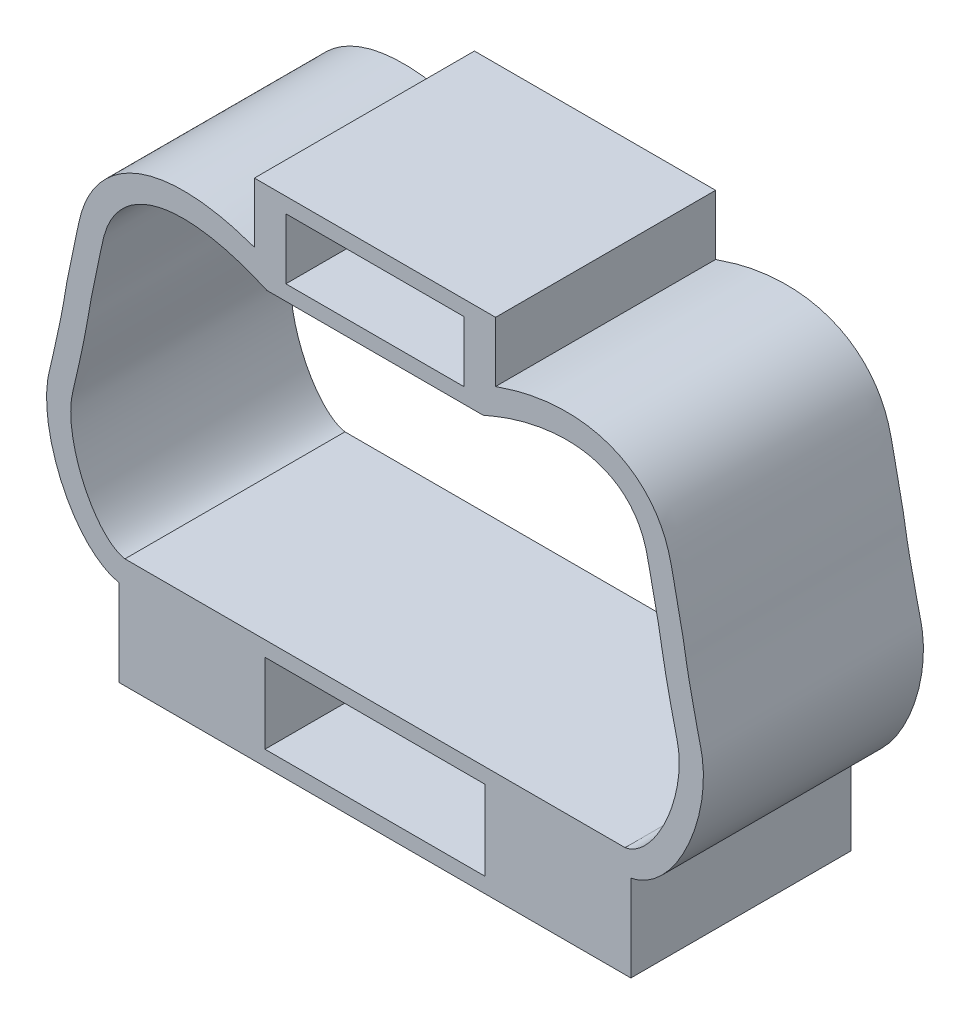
ISO-10303-21;
HEADER;
FILE_DESCRIPTION(('STEP AP214'),'2;1');
FILE_NAME('part.step','',(''),(''),'','','');
FILE_SCHEMA(('AUTOMOTIVE_DESIGN { 1 0 10303 214 1 1 1 1 }'));
ENDSEC;
DATA;
#1=APPLICATION_CONTEXT('core data for automotive mechanical design processes');
#2=APPLICATION_PROTOCOL_DEFINITION('international standard','automotive_design',2000,#1);
#3=PRODUCT_CONTEXT('',#1,'mechanical');
#4=PRODUCT('Part','Part','',(#3));
#5=PRODUCT_RELATED_PRODUCT_CATEGORY('part','',(#4));
#6=PRODUCT_DEFINITION_FORMATION('','',#4);
#7=PRODUCT_DEFINITION_CONTEXT('part definition',#1,'design');
#8=PRODUCT_DEFINITION('design','',#6,#7);
#9=PRODUCT_DEFINITION_SHAPE('','',#8);
#10=(LENGTH_UNIT() NAMED_UNIT(*) SI_UNIT(.MILLI.,.METRE.));
#11=(NAMED_UNIT(*) PLANE_ANGLE_UNIT() SI_UNIT($,.RADIAN.));
#12=(NAMED_UNIT(*) SI_UNIT($,.STERADIAN.) SOLID_ANGLE_UNIT());
#13=UNCERTAINTY_MEASURE_WITH_UNIT(LENGTH_MEASURE(1.E-05),#10,'distance_accuracy_value','');
#14=(GEOMETRIC_REPRESENTATION_CONTEXT(3) GLOBAL_UNCERTAINTY_ASSIGNED_CONTEXT((#13)) GLOBAL_UNIT_ASSIGNED_CONTEXT((#10,
#11,#12)) REPRESENTATION_CONTEXT('',''));
#15=CARTESIAN_POINT('',(0.,0.,0.));
#16=DIRECTION('',(0.,0.,1.));
#17=DIRECTION('',(1.,0.,0.));
#18=AXIS2_PLACEMENT_3D('',#15,#16,#17);
#19=CARTESIAN_POINT('',(0.,0.,5.8));
#20=CARTESIAN_POINT('',(-0.03244984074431,0.0069530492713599,5.8));
#21=CARTESIAN_POINT('',(-0.064899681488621,0.0139060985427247,5.8));
#22=CARTESIAN_POINT('',(-0.0964411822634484,0.0238598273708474,5.8));
#23=CARTESIAN_POINT('',(-0.135220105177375,0.0360975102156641,5.8));
#24=CARTESIAN_POINT('',(-0.172626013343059,0.052870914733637,5.8));
#25=CARTESIAN_POINT('',(-0.208781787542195,0.0718079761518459,5.8));
#26=CARTESIAN_POINT('',(-0.253942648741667,0.0954615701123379,5.8));
#27=CARTESIAN_POINT('',(-0.297153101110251,0.122490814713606,5.8));
#28=CARTESIAN_POINT('',(-0.338493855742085,0.152129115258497,5.8));
#29=CARTESIAN_POINT('',(-0.390467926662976,0.189390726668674,5.8));
#30=CARTESIAN_POINT('',(-0.439486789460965,0.230776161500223,5.8));
#31=CARTESIAN_POINT('',(-0.486032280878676,0.274697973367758,5.8));
#32=CARTESIAN_POINT('',(-0.544303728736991,0.329684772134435,5.8));
#33=CARTESIAN_POINT('',(-0.598698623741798,0.388646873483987,5.8));
#34=CARTESIAN_POINT('',(-0.649893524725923,0.450231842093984,5.8));
#35=CARTESIAN_POINT('',(-0.712976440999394,0.526117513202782,5.8));
#36=CARTESIAN_POINT('',(-0.771200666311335,0.605985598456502,5.8));
#37=CARTESIAN_POINT('',(-0.82537937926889,0.688467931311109,5.8));
#38=CARTESIAN_POINT('',(-0.890267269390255,0.78725404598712,5.8));
#39=CARTESIAN_POINT('',(-0.949352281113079,0.889790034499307,5.8));
#40=CARTESIAN_POINT('',(-1.00336555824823,0.994907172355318,5.8));
#41=CARTESIAN_POINT('',(-1.06540609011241,1.11564643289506,5.8));
#42=CARTESIAN_POINT('',(-1.12075538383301,1.23979105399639,5.8));
#43=CARTESIAN_POINT('',(-1.16980101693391,1.36637018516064,5.8));
#44=CARTESIAN_POINT('',(-1.22310021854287,1.50392711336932,5.8));
#45=CARTESIAN_POINT('',(-1.26895495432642,1.64435913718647,5.8));
#46=CARTESIAN_POINT('',(-1.3069907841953,1.78690489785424,5.8));
#47=CARTESIAN_POINT('',(-1.34561716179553,1.9316638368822,5.8));
#48=CARTESIAN_POINT('',(-1.37617995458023,2.07860265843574,5.8));
#49=CARTESIAN_POINT('',(-1.39733410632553,2.22694094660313,5.8));
#50=CARTESIAN_POINT('',(-1.41722863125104,2.3664464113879,5.8));
#51=CARTESIAN_POINT('',(-1.42880163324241,2.50718964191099,5.8));
#52=CARTESIAN_POINT('',(-1.42867023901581,2.64824310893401,5.8));
#53=CARTESIAN_POINT('',(-1.4285561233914,2.77074776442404,5.8));
#54=CARTESIAN_POINT('',(-1.41961351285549,2.89348642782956,5.8));
#55=CARTESIAN_POINT('',(-1.39858304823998,3.01391825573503,5.8));
#56=CARTESIAN_POINT('',(-1.38096385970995,3.11481526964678,5.8));
#57=CARTESIAN_POINT('',(-1.35486022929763,3.21409312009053,5.8));
#58=CARTESIAN_POINT('',(-1.33079812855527,3.3137469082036,5.8));
#59=CARTESIAN_POINT('',(-1.30946610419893,3.40209401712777,5.8));
#60=CARTESIAN_POINT('',(-1.28973862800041,3.49073659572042,5.8));
#61=CARTESIAN_POINT('',(-1.26979374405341,3.57934967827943,5.8));
#62=CARTESIAN_POINT('',(-1.25203180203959,3.65826417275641,5.8));
#63=CARTESIAN_POINT('',(-1.23409743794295,3.73715527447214,5.8));
#64=CARTESIAN_POINT('',(-1.21644175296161,3.81610451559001,5.8));
#65=CARTESIAN_POINT('',(-1.20070606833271,3.88646827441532,5.8));
#66=CARTESIAN_POINT('',(-1.18519174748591,3.9568782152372,5.8));
#67=CARTESIAN_POINT('',(-1.16983820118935,4.02732408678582,5.8));
#68=CARTESIAN_POINT('',(-1.15614749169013,4.09014045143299,5.8));
#69=CARTESIAN_POINT('',(-1.14258461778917,4.1529853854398,5.8));
#70=CARTESIAN_POINT('',(-1.12920363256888,4.21586891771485,5.8));
#71=CARTESIAN_POINT('',(-1.11726938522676,4.27195354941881,5.8));
#72=CARTESIAN_POINT('',(-1.10547982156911,4.32806888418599,5.8));
#73=CARTESIAN_POINT('',(-1.09386301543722,4.38422005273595,5.8));
#74=CARTESIAN_POINT('',(-1.08350314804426,4.43429566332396,5.8));
#75=CARTESIAN_POINT('',(-1.07328067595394,4.48439977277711,5.8));
#76=CARTESIAN_POINT('',(-1.06322938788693,4.53453827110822,5.8));
#77=CARTESIAN_POINT('',(-1.05426923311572,4.57923390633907,5.8));
#78=CARTESIAN_POINT('',(-1.04544511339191,4.6239568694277,5.8));
#79=CARTESIAN_POINT('',(-1.03679044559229,4.66871266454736,5.8));
#80=CARTESIAN_POINT('',(-1.02908089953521,4.70858096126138,5.8));
#81=CARTESIAN_POINT('',(-1.02150581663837,4.74847531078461,5.8));
#82=CARTESIAN_POINT('',(-1.014097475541,4.78840073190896,5.8));
#83=CARTESIAN_POINT('',(-1.00750525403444,4.82392787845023,5.8));
#84=CARTESIAN_POINT('',(-1.00104506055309,4.85947962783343,5.8));
#85=CARTESIAN_POINT('',(-0.994756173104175,4.89506166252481,5.8));
#86=CARTESIAN_POINT('',(-0.989168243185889,4.92667773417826,5.8));
#87=CARTESIAN_POINT('',(-0.983715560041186,4.95831771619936,5.8));
#88=CARTESIAN_POINT('',(-0.978418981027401,4.98998411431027,5.8));
#89=CARTESIAN_POINT('',(-0.973721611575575,5.0180680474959,5.8));
#90=CARTESIAN_POINT('',(-0.969147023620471,5.04617275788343,5.8));
#91=CARTESIAN_POINT('',(-0.964778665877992,5.07430951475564,5.8));
#92=CARTESIAN_POINT('',(-0.960816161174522,5.09983215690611,5.8));
#93=CARTESIAN_POINT('',(-0.957023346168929,5.12538116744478,5.8));
#94=CARTESIAN_POINT('',(-0.953020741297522,5.15089741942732,5.8));
#95=CARTESIAN_POINT('',(-0.948787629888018,5.17788313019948,5.8));
#96=CARTESIAN_POINT('',(-0.944319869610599,5.20483220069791,5.8));
#97=CARTESIAN_POINT('',(-0.939723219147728,5.23175883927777,5.8));
#98=CARTESIAN_POINT('',(-0.934711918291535,5.26111445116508,5.8));
#99=CARTESIAN_POINT('',(-0.929547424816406,5.29044340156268,5.8));
#100=CARTESIAN_POINT('',(-0.924262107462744,5.31975056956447,5.8));
#101=CARTESIAN_POINT('',(-0.918468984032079,5.35187353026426,5.8));
#102=CARTESIAN_POINT('',(-0.912530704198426,5.38397032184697,5.8));
#103=CARTESIAN_POINT('',(-0.906491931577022,5.41604808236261,5.8));
#104=CARTESIAN_POINT('',(-0.899836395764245,5.45140206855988,5.8));
#105=CARTESIAN_POINT('',(-0.89305879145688,5.48673293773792,5.8));
#106=CARTESIAN_POINT('',(-0.886192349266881,5.52204649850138,5.8));
#107=CARTESIAN_POINT('',(-0.878580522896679,5.56119351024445,5.8));
#108=CARTESIAN_POINT('',(-0.870859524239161,5.60031925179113,5.8));
#109=CARTESIAN_POINT('',(-0.863060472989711,5.63942939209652,5.8));
#110=CARTESIAN_POINT('',(-0.854360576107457,5.68305703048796,5.8));
#111=CARTESIAN_POINT('',(-0.845563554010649,5.72666525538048,5.8));
#112=CARTESIAN_POINT('',(-0.836696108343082,5.77025912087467,5.8));
#113=CARTESIAN_POINT('',(-0.826736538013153,5.81922205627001,5.8));
#114=CARTESIAN_POINT('',(-0.816688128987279,5.86816687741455,5.8));
#115=CARTESIAN_POINT('',(-0.806578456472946,5.91709906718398,5.8));
#116=CARTESIAN_POINT('',(-0.795137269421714,5.97247596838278,5.8));
#117=CARTESIAN_POINT('',(-0.783617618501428,6.02783669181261,5.8));
#118=CARTESIAN_POINT('',(-0.772031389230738,6.08318328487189,5.8));
#119=CARTESIAN_POINT('',(-0.758807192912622,6.14635433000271,5.8));
#120=CARTESIAN_POINT('',(-0.745496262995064,6.20950696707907,5.8));
#121=CARTESIAN_POINT('',(-0.732172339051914,6.27265760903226,5.8));
#122=CARTESIAN_POINT('',(-0.716817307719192,6.34543497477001,5.8));
#123=CARTESIAN_POINT('',(-0.701445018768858,6.41820969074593,5.8));
#124=CARTESIAN_POINT('',(-0.685836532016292,6.49093085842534,5.8));
#125=CARTESIAN_POINT('',(-0.667648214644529,6.57567165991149,5.8));
#126=CARTESIAN_POINT('',(-0.649139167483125,6.66033974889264,5.8));
#127=CARTESIAN_POINT('',(-0.631462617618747,6.7452002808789,5.8));
#128=CARTESIAN_POINT('',(-0.610725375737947,6.8447544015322,5.8));
#129=CARTESIAN_POINT('',(-0.591133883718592,6.94457337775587,5.8));
#130=CARTESIAN_POINT('',(-0.566074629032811,7.04314994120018,5.8));
#131=CARTESIAN_POINT('',(-0.539919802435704,7.14603619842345,5.8));
#132=CARTESIAN_POINT('',(-0.507808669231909,7.24756903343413,5.8));
#133=CARTESIAN_POINT('',(-0.46794439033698,7.34602617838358,5.8));
#134=CARTESIAN_POINT('',(-0.428117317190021,7.44439143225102,5.8));
#135=CARTESIAN_POINT('',(-0.380551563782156,7.53968673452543,5.8));
#136=CARTESIAN_POINT('',(-0.325211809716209,7.63028284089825,5.8));
#137=CARTESIAN_POINT('',(-0.269256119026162,7.72188729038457,5.8));
#138=CARTESIAN_POINT('',(-0.205352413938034,7.80868735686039,5.8));
#139=CARTESIAN_POINT('',(-0.133974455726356,7.88887017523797,5.8));
#140=CARTESIAN_POINT('',(-0.0604493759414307,7.97146497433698,5.8));
#141=CARTESIAN_POINT('',(0.0210063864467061,8.0470384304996,5.8));
#142=CARTESIAN_POINT('',(0.108786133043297,8.11431005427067,5.8));
#143=CARTESIAN_POINT('',(0.2012446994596,8.18516737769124,5.8));
#144=CARTESIAN_POINT('',(0.30071937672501,8.24681427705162,5.8));
#145=CARTESIAN_POINT('',(0.404842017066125,8.29902321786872,5.8));
#146=CARTESIAN_POINT('',(0.516832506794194,8.35517723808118,5.8));
#147=CARTESIAN_POINT('',(0.634199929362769,8.40041308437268,5.8));
#148=CARTESIAN_POINT('',(0.754373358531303,8.43574754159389,5.8));
#149=CARTESIAN_POINT('',(0.885542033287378,8.47431491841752,5.8));
#150=CARTESIAN_POINT('',(1.02005367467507,8.50108616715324,5.8));
#151=CARTESIAN_POINT('',(1.15568744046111,8.51802085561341,5.8));
#152=CARTESIAN_POINT('',(1.30465616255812,8.53662049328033,5.8));
#153=CARTESIAN_POINT('',(1.45497850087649,8.54335430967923,5.8));
#154=CARTESIAN_POINT('',(1.60505322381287,8.54068303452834,5.8));
#155=CARTESIAN_POINT('',(1.76958998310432,8.53775434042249,5.8));
#156=CARTESIAN_POINT('',(1.93382910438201,8.52352056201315,5.8));
#157=CARTESIAN_POINT('',(2.09669583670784,8.50033726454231,5.8));
#158=CARTESIAN_POINT('',(2.27385409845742,8.47511963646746,5.8));
#159=CARTESIAN_POINT('',(2.44938854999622,8.43931294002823,5.8));
#160=CARTESIAN_POINT('',(2.62297729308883,8.39570490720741,5.8));
#161=CARTESIAN_POINT('',(2.80956430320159,8.34883151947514,5.8));
#162=CARTESIAN_POINT('',(2.99390330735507,8.29294473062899,5.8));
#163=CARTESIAN_POINT('',(3.17476216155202,8.22781613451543,5.8));
#164=CARTESIAN_POINT('',(3.36642552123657,8.15879675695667,5.8));
#165=CARTESIAN_POINT('',(3.55418050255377,8.07939837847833,5.8));
#166=CARTESIAN_POINT('',(3.74193548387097,8.,5.8));
#167=B_SPLINE_CURVE_WITH_KNOTS('',3,(#19,#20,#21,#22,#23,#24,#25,#26,#27,#28,#29,#30,#31,#32,
#33,#34,#35,#36,#37,#38,#39,#40,#41,#42,#43,#44,#45,#46,#47,#48,#49,#50,#51,#52,#53,#54,#55,#56,
#57,#58,#59,#60,#61,#62,#63,#64,#65,#66,#67,#68,#69,#70,#71,#72,#73,#74,#75,#76,#77,#78,#79,#80,
#81,#82,#83,#84,#85,#86,#87,#88,#89,#90,#91,#92,#93,#94,#95,#96,#97,#98,#99,#100,#101,#102,#103,
#104,#105,#106,#107,#108,#109,#110,#111,#112,#113,#114,#115,#116,#117,#118,#119,#120,#121,#122,
#123,#124,#125,#126,#127,#128,#129,#130,#131,#132,#133,#134,#135,#136,#137,#138,#139,#140,#141,
#142,#143,#144,#145,#146,#147,#148,#149,#150,#151,#152,#153,#154,#155,#156,#157,#158,#159,#160,
#161,#162,#163,#164,#165,#166),.UNSPECIFIED.,.F.,.F.,(4,3,3,3,3,3,3,3,3,3,3,3,3,3,3,3,3,3,3,3,3,
3,3,3,3,3,3,3,3,3,3,3,3,3,3,3,3,3,3,3,3,3,3,3,3,3,3,3,3,4),(0.,0.09934884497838,
0.22149399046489,0.37406104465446,0.5658700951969,0.80600057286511,1.1018919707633,
1.45627042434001,1.86331530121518,2.30566185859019,2.75487632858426,3.17734226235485,
3.54425308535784,3.85164862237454,4.12416718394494,4.36685893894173,4.58315872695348,
4.77603257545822,4.94805310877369,5.10146101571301,5.23821548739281,5.36003586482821,
5.46843623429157,5.56475433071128,5.65017582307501,5.7276610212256,5.80960852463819,
5.89894827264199,5.9968716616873,6.10479634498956,6.22443675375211,6.35789647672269,
6.50779325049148,6.67743247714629,6.87105392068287,7.0941911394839,7.35420933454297,
7.65924964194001,7.97762608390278,8.29570538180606,8.61732493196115,8.94861912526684,
9.29757190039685,9.67289269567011,10.082553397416,10.5324902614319,11.0257855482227,
11.5623674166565,12.1391283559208,12.7503449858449),.UNSPECIFIED.);
#168=DIRECTION('',(0.,0.,-1.));
#169=VECTOR('',#168,1.);
#170=SURFACE_OF_LINEAR_EXTRUSION('',#167,#169);
#171=CARTESIAN_POINT('',(0.,0.,0.));
#172=CARTESIAN_POINT('',(-0.03244984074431,0.0069530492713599,0.));
#173=CARTESIAN_POINT('',(-0.064899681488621,0.0139060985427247,0.));
#174=CARTESIAN_POINT('',(-0.0964411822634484,0.0238598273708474,0.));
#175=CARTESIAN_POINT('',(-0.135220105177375,0.0360975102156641,0.));
#176=CARTESIAN_POINT('',(-0.172626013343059,0.052870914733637,0.));
#177=CARTESIAN_POINT('',(-0.208781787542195,0.0718079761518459,0.));
#178=CARTESIAN_POINT('',(-0.253942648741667,0.0954615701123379,0.));
#179=CARTESIAN_POINT('',(-0.297153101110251,0.122490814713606,0.));
#180=CARTESIAN_POINT('',(-0.338493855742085,0.152129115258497,0.));
#181=CARTESIAN_POINT('',(-0.390467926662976,0.189390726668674,0.));
#182=CARTESIAN_POINT('',(-0.439486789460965,0.230776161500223,0.));
#183=CARTESIAN_POINT('',(-0.486032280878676,0.274697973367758,0.));
#184=CARTESIAN_POINT('',(-0.544303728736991,0.329684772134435,0.));
#185=CARTESIAN_POINT('',(-0.598698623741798,0.388646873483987,0.));
#186=CARTESIAN_POINT('',(-0.649893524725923,0.450231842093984,0.));
#187=CARTESIAN_POINT('',(-0.712976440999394,0.526117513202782,0.));
#188=CARTESIAN_POINT('',(-0.771200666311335,0.605985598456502,0.));
#189=CARTESIAN_POINT('',(-0.82537937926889,0.688467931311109,0.));
#190=CARTESIAN_POINT('',(-0.890267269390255,0.78725404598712,0.));
#191=CARTESIAN_POINT('',(-0.949352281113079,0.889790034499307,0.));
#192=CARTESIAN_POINT('',(-1.00336555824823,0.994907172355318,0.));
#193=CARTESIAN_POINT('',(-1.06540609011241,1.11564643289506,0.));
#194=CARTESIAN_POINT('',(-1.12075538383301,1.23979105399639,0.));
#195=CARTESIAN_POINT('',(-1.16980101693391,1.36637018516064,0.));
#196=CARTESIAN_POINT('',(-1.22310021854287,1.50392711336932,0.));
#197=CARTESIAN_POINT('',(-1.26895495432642,1.64435913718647,0.));
#198=CARTESIAN_POINT('',(-1.3069907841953,1.78690489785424,0.));
#199=CARTESIAN_POINT('',(-1.34561716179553,1.9316638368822,0.));
#200=CARTESIAN_POINT('',(-1.37617995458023,2.07860265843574,0.));
#201=CARTESIAN_POINT('',(-1.39733410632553,2.22694094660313,0.));
#202=CARTESIAN_POINT('',(-1.41722863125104,2.3664464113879,0.));
#203=CARTESIAN_POINT('',(-1.42880163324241,2.50718964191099,0.));
#204=CARTESIAN_POINT('',(-1.42867023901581,2.64824310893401,0.));
#205=CARTESIAN_POINT('',(-1.4285561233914,2.77074776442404,0.));
#206=CARTESIAN_POINT('',(-1.41961351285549,2.89348642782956,0.));
#207=CARTESIAN_POINT('',(-1.39858304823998,3.01391825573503,0.));
#208=CARTESIAN_POINT('',(-1.38096385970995,3.11481526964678,0.));
#209=CARTESIAN_POINT('',(-1.35486022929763,3.21409312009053,0.));
#210=CARTESIAN_POINT('',(-1.33079812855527,3.3137469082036,0.));
#211=CARTESIAN_POINT('',(-1.30946610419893,3.40209401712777,0.));
#212=CARTESIAN_POINT('',(-1.28973862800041,3.49073659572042,0.));
#213=CARTESIAN_POINT('',(-1.26979374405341,3.57934967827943,0.));
#214=CARTESIAN_POINT('',(-1.25203180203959,3.65826417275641,0.));
#215=CARTESIAN_POINT('',(-1.23409743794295,3.73715527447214,0.));
#216=CARTESIAN_POINT('',(-1.21644175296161,3.81610451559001,0.));
#217=CARTESIAN_POINT('',(-1.20070606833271,3.88646827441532,0.));
#218=CARTESIAN_POINT('',(-1.18519174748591,3.9568782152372,0.));
#219=CARTESIAN_POINT('',(-1.16983820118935,4.02732408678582,0.));
#220=CARTESIAN_POINT('',(-1.15614749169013,4.09014045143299,0.));
#221=CARTESIAN_POINT('',(-1.14258461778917,4.1529853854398,0.));
#222=CARTESIAN_POINT('',(-1.12920363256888,4.21586891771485,0.));
#223=CARTESIAN_POINT('',(-1.11726938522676,4.27195354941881,0.));
#224=CARTESIAN_POINT('',(-1.10547982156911,4.32806888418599,0.));
#225=CARTESIAN_POINT('',(-1.09386301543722,4.38422005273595,0.));
#226=CARTESIAN_POINT('',(-1.08350314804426,4.43429566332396,0.));
#227=CARTESIAN_POINT('',(-1.07328067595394,4.48439977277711,0.));
#228=CARTESIAN_POINT('',(-1.06322938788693,4.53453827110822,0.));
#229=CARTESIAN_POINT('',(-1.05426923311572,4.57923390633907,0.));
#230=CARTESIAN_POINT('',(-1.04544511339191,4.6239568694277,0.));
#231=CARTESIAN_POINT('',(-1.03679044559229,4.66871266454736,0.));
#232=CARTESIAN_POINT('',(-1.02908089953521,4.70858096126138,0.));
#233=CARTESIAN_POINT('',(-1.02150581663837,4.74847531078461,0.));
#234=CARTESIAN_POINT('',(-1.014097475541,4.78840073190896,0.));
#235=CARTESIAN_POINT('',(-1.00750525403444,4.82392787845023,0.));
#236=CARTESIAN_POINT('',(-1.00104506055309,4.85947962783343,0.));
#237=CARTESIAN_POINT('',(-0.994756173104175,4.89506166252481,0.));
#238=CARTESIAN_POINT('',(-0.989168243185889,4.92667773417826,0.));
#239=CARTESIAN_POINT('',(-0.983715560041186,4.95831771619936,0.));
#240=CARTESIAN_POINT('',(-0.978418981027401,4.98998411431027,0.));
#241=CARTESIAN_POINT('',(-0.973721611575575,5.0180680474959,0.));
#242=CARTESIAN_POINT('',(-0.969147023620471,5.04617275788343,0.));
#243=CARTESIAN_POINT('',(-0.964778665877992,5.07430951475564,0.));
#244=CARTESIAN_POINT('',(-0.960816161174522,5.09983215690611,0.));
#245=CARTESIAN_POINT('',(-0.957023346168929,5.12538116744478,0.));
#246=CARTESIAN_POINT('',(-0.953020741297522,5.15089741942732,0.));
#247=CARTESIAN_POINT('',(-0.948787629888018,5.17788313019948,0.));
#248=CARTESIAN_POINT('',(-0.944319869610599,5.20483220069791,0.));
#249=CARTESIAN_POINT('',(-0.939723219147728,5.23175883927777,0.));
#250=CARTESIAN_POINT('',(-0.934711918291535,5.26111445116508,0.));
#251=CARTESIAN_POINT('',(-0.929547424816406,5.29044340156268,0.));
#252=CARTESIAN_POINT('',(-0.924262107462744,5.31975056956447,0.));
#253=CARTESIAN_POINT('',(-0.918468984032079,5.35187353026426,0.));
#254=CARTESIAN_POINT('',(-0.912530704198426,5.38397032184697,0.));
#255=CARTESIAN_POINT('',(-0.906491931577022,5.41604808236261,0.));
#256=CARTESIAN_POINT('',(-0.899836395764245,5.45140206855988,0.));
#257=CARTESIAN_POINT('',(-0.89305879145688,5.48673293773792,0.));
#258=CARTESIAN_POINT('',(-0.886192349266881,5.52204649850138,0.));
#259=CARTESIAN_POINT('',(-0.878580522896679,5.56119351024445,0.));
#260=CARTESIAN_POINT('',(-0.870859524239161,5.60031925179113,0.));
#261=CARTESIAN_POINT('',(-0.863060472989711,5.63942939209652,0.));
#262=CARTESIAN_POINT('',(-0.854360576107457,5.68305703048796,0.));
#263=CARTESIAN_POINT('',(-0.845563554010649,5.72666525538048,0.));
#264=CARTESIAN_POINT('',(-0.836696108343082,5.77025912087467,0.));
#265=CARTESIAN_POINT('',(-0.826736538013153,5.81922205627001,0.));
#266=CARTESIAN_POINT('',(-0.816688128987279,5.86816687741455,0.));
#267=CARTESIAN_POINT('',(-0.806578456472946,5.91709906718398,0.));
#268=CARTESIAN_POINT('',(-0.795137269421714,5.97247596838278,0.));
#269=CARTESIAN_POINT('',(-0.783617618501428,6.02783669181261,0.));
#270=CARTESIAN_POINT('',(-0.772031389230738,6.08318328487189,0.));
#271=CARTESIAN_POINT('',(-0.758807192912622,6.14635433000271,0.));
#272=CARTESIAN_POINT('',(-0.745496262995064,6.20950696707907,0.));
#273=CARTESIAN_POINT('',(-0.732172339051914,6.27265760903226,0.));
#274=CARTESIAN_POINT('',(-0.716817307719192,6.34543497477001,0.));
#275=CARTESIAN_POINT('',(-0.701445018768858,6.41820969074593,0.));
#276=CARTESIAN_POINT('',(-0.685836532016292,6.49093085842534,0.));
#277=CARTESIAN_POINT('',(-0.667648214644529,6.57567165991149,0.));
#278=CARTESIAN_POINT('',(-0.649139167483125,6.66033974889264,0.));
#279=CARTESIAN_POINT('',(-0.631462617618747,6.7452002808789,0.));
#280=CARTESIAN_POINT('',(-0.610725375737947,6.8447544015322,0.));
#281=CARTESIAN_POINT('',(-0.591133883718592,6.94457337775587,0.));
#282=CARTESIAN_POINT('',(-0.566074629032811,7.04314994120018,0.));
#283=CARTESIAN_POINT('',(-0.539919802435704,7.14603619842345,0.));
#284=CARTESIAN_POINT('',(-0.507808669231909,7.24756903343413,0.));
#285=CARTESIAN_POINT('',(-0.46794439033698,7.34602617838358,0.));
#286=CARTESIAN_POINT('',(-0.428117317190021,7.44439143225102,0.));
#287=CARTESIAN_POINT('',(-0.380551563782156,7.53968673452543,0.));
#288=CARTESIAN_POINT('',(-0.325211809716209,7.63028284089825,0.));
#289=CARTESIAN_POINT('',(-0.269256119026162,7.72188729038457,0.));
#290=CARTESIAN_POINT('',(-0.205352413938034,7.80868735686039,0.));
#291=CARTESIAN_POINT('',(-0.133974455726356,7.88887017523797,0.));
#292=CARTESIAN_POINT('',(-0.0604493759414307,7.97146497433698,0.));
#293=CARTESIAN_POINT('',(0.0210063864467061,8.0470384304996,0.));
#294=CARTESIAN_POINT('',(0.108786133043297,8.11431005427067,0.));
#295=CARTESIAN_POINT('',(0.2012446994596,8.18516737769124,0.));
#296=CARTESIAN_POINT('',(0.30071937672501,8.24681427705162,0.));
#297=CARTESIAN_POINT('',(0.404842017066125,8.29902321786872,0.));
#298=CARTESIAN_POINT('',(0.516832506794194,8.35517723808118,0.));
#299=CARTESIAN_POINT('',(0.634199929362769,8.40041308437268,0.));
#300=CARTESIAN_POINT('',(0.754373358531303,8.43574754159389,0.));
#301=CARTESIAN_POINT('',(0.885542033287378,8.47431491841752,0.));
#302=CARTESIAN_POINT('',(1.02005367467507,8.50108616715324,0.));
#303=CARTESIAN_POINT('',(1.15568744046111,8.51802085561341,0.));
#304=CARTESIAN_POINT('',(1.30465616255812,8.53662049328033,0.));
#305=CARTESIAN_POINT('',(1.45497850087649,8.54335430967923,0.));
#306=CARTESIAN_POINT('',(1.60505322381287,8.54068303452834,0.));
#307=CARTESIAN_POINT('',(1.76958998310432,8.53775434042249,0.));
#308=CARTESIAN_POINT('',(1.93382910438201,8.52352056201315,0.));
#309=CARTESIAN_POINT('',(2.09669583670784,8.50033726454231,0.));
#310=CARTESIAN_POINT('',(2.27385409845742,8.47511963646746,0.));
#311=CARTESIAN_POINT('',(2.44938854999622,8.43931294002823,0.));
#312=CARTESIAN_POINT('',(2.62297729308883,8.39570490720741,0.));
#313=CARTESIAN_POINT('',(2.80956430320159,8.34883151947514,0.));
#314=CARTESIAN_POINT('',(2.99390330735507,8.29294473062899,0.));
#315=CARTESIAN_POINT('',(3.17476216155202,8.22781613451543,0.));
#316=CARTESIAN_POINT('',(3.36642552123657,8.15879675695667,0.));
#317=CARTESIAN_POINT('',(3.55418050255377,8.07939837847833,0.));
#318=CARTESIAN_POINT('',(3.74193548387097,8.,0.));
#319=B_SPLINE_CURVE_WITH_KNOTS('',3,(#171,#172,#173,#174,#175,#176,#177,#178,#179,#180,#181,
#182,#183,#184,#185,#186,#187,#188,#189,#190,#191,#192,#193,#194,#195,#196,#197,#198,#199,#200,
#201,#202,#203,#204,#205,#206,#207,#208,#209,#210,#211,#212,#213,#214,#215,#216,#217,#218,#219,
#220,#221,#222,#223,#224,#225,#226,#227,#228,#229,#230,#231,#232,#233,#234,#235,#236,#237,#238,
#239,#240,#241,#242,#243,#244,#245,#246,#247,#248,#249,#250,#251,#252,#253,#254,#255,#256,#257,
#258,#259,#260,#261,#262,#263,#264,#265,#266,#267,#268,#269,#270,#271,#272,#273,#274,#275,#276,
#277,#278,#279,#280,#281,#282,#283,#284,#285,#286,#287,#288,#289,#290,#291,#292,#293,#294,#295,
#296,#297,#298,#299,#300,#301,#302,#303,#304,#305,#306,#307,#308,#309,#310,#311,#312,#313,#314,
#315,#316,#317,#318),.UNSPECIFIED.,.F.,.F.,(4,3,3,3,3,3,3,3,3,3,3,3,3,3,3,3,3,3,3,3,3,3,3,3,3,3,
3,3,3,3,3,3,3,3,3,3,3,3,3,3,3,3,3,3,3,3,3,3,3,4),(0.,0.09934884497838,0.22149399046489,
0.37406104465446,0.5658700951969,0.80600057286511,1.1018919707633,1.45627042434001,
1.86331530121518,2.30566185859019,2.75487632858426,3.17734226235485,3.54425308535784,
3.85164862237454,4.12416718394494,4.36685893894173,4.58315872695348,4.77603257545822,
4.94805310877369,5.10146101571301,5.23821548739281,5.36003586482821,5.46843623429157,
5.56475433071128,5.65017582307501,5.7276610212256,5.80960852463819,5.89894827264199,
5.9968716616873,6.10479634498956,6.22443675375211,6.35789647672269,6.50779325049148,
6.67743247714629,6.87105392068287,7.0941911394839,7.35420933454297,7.65924964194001,
7.97762608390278,8.29570538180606,8.61732493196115,8.94861912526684,9.29757190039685,
9.67289269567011,10.082553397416,10.5324902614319,11.0257855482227,11.5623674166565,
12.1391283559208,12.7503449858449),.UNSPECIFIED.);
#320=CARTESIAN_POINT('',(0.,0.,0.));
#321=VERTEX_POINT('',#320);
#322=CARTESIAN_POINT('',(3.74193548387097,8.,0.));
#323=VERTEX_POINT('',#322);
#324=EDGE_CURVE('E159',#321,#323,#319,.T.);
#325=ORIENTED_EDGE('',*,*,#324,.T.);
#326=DIRECTION('',(0.,0.,-1.));
#327=VECTOR('',#326,1.);
#328=CARTESIAN_POINT('',(3.74193548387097,8.,5.8));
#329=LINE('',#328,#327);
#330=CARTESIAN_POINT('',(3.74193548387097,8.,5.8));
#331=VERTEX_POINT('',#330);
#332=EDGE_CURVE('E11',#331,#323,#329,.T.);
#333=ORIENTED_EDGE('',*,*,#332,.F.);
#334=CARTESIAN_POINT('',(0.,0.,5.8));
#335=VERTEX_POINT('',#334);
#336=EDGE_CURVE('E200',#335,#331,#167,.T.);
#337=ORIENTED_EDGE('',*,*,#336,.F.);
#338=DIRECTION('',(0.,0.,-1.));
#339=VECTOR('',#338,1.);
#340=CARTESIAN_POINT('',(0.,0.,5.8));
#341=LINE('',#340,#339);
#342=EDGE_CURVE('E158',#335,#321,#341,.T.);
#343=ORIENTED_EDGE('',*,*,#342,.T.);
#344=EDGE_LOOP('',(#325,#333,#337,#343));
#345=FACE_BOUND('',#344,.T.);
#346=ADVANCED_FACE('F34',(#345),#170,.F.);
#347=CARTESIAN_POINT('',(3.74193548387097,8.,5.8));
#348=DIRECTION('',(0.,1.,0.));
#349=DIRECTION('',(0.,0.,1.));
#350=AXIS2_PLACEMENT_3D('',#347,#348,#349);
#351=PLANE('',#350);
#352=DIRECTION('',(1.,0.,0.));
#353=VECTOR('',#352,1.);
#354=CARTESIAN_POINT('',(3.74193548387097,8.,0.));
#355=LINE('',#354,#353);
#356=CARTESIAN_POINT('',(9.44193548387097,8.,0.));
#357=VERTEX_POINT('',#356);
#358=EDGE_CURVE('E164',#323,#357,#355,.T.);
#359=ORIENTED_EDGE('',*,*,#358,.T.);
#360=DIRECTION('',(0.,0.,-1.));
#361=VECTOR('',#360,1.);
#362=CARTESIAN_POINT('',(9.44193548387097,8.,5.8));
#363=LINE('',#362,#361);
#364=CARTESIAN_POINT('',(9.44193548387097,8.,5.8));
#365=VERTEX_POINT('',#364);
#366=EDGE_CURVE('E257',#365,#357,#363,.T.);
#367=ORIENTED_EDGE('',*,*,#366,.F.);
#368=DIRECTION('',(1.,0.,0.));
#369=VECTOR('',#368,1.);
#370=CARTESIAN_POINT('',(3.74193548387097,8.,5.8));
#371=LINE('',#370,#369);
#372=EDGE_CURVE('E103',#331,#365,#371,.T.);
#373=ORIENTED_EDGE('',*,*,#372,.F.);
#374=ORIENTED_EDGE('',*,*,#332,.T.);
#375=EDGE_LOOP('',(#359,#367,#373,#374));
#376=FACE_BOUND('',#375,.T.);
#377=ADVANCED_FACE('F323',(#376),#351,.F.);
#378=CARTESIAN_POINT('',(6.59193548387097,8.4,5.8));
#379=DIRECTION('',(0.,-1.,0.));
#380=DIRECTION('',(0.,0.,-1.));
#381=AXIS2_PLACEMENT_3D('',#378,#379,#380);
#382=PLANE('',#381);
#383=DIRECTION('',(-1.,0.,0.));
#384=VECTOR('',#383,1.);
#385=CARTESIAN_POINT('',(6.59193548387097,8.4,0.));
#386=LINE('',#385,#384);
#387=CARTESIAN_POINT('',(8.94193548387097,8.4,0.));
#388=VERTEX_POINT('',#387);
#389=CARTESIAN_POINT('',(4.24193548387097,8.4,0.));
#390=VERTEX_POINT('',#389);
#391=EDGE_CURVE('E171',#388,#390,#386,.T.);
#392=ORIENTED_EDGE('',*,*,#391,.T.);
#393=DIRECTION('',(0.,0.,-1.));
#394=VECTOR('',#393,1.);
#395=CARTESIAN_POINT('',(4.24193548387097,8.4,5.8));
#396=LINE('',#395,#394);
#397=CARTESIAN_POINT('',(4.24193548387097,8.4,5.8));
#398=VERTEX_POINT('',#397);
#399=EDGE_CURVE('E43',#398,#390,#396,.T.);
#400=ORIENTED_EDGE('',*,*,#399,.F.);
#401=DIRECTION('',(-1.,0.,0.));
#402=VECTOR('',#401,1.);
#403=CARTESIAN_POINT('',(6.59193548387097,8.4,5.8));
#404=LINE('',#403,#402);
#405=CARTESIAN_POINT('',(8.94193548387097,8.4,5.8));
#406=VERTEX_POINT('',#405);
#407=EDGE_CURVE('E282',#406,#398,#404,.T.);
#408=ORIENTED_EDGE('',*,*,#407,.F.);
#409=DIRECTION('',(0.,0.,-1.));
#410=VECTOR('',#409,1.);
#411=CARTESIAN_POINT('',(8.94193548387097,8.4,5.8));
#412=LINE('',#411,#410);
#413=EDGE_CURVE('E252',#406,#388,#412,.T.);
#414=ORIENTED_EDGE('',*,*,#413,.T.);
#415=EDGE_LOOP('',(#392,#400,#408,#414));
#416=FACE_BOUND('',#415,.T.);
#417=ADVANCED_FACE('F321',(#416),#382,.F.);
#418=CARTESIAN_POINT('',(4.24193548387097,8.4,5.8));
#419=DIRECTION('',(-1.,0.,0.));
#420=DIRECTION('',(0.,0.,1.));
#421=AXIS2_PLACEMENT_3D('',#418,#419,#420);
#422=PLANE('',#421);
#423=DIRECTION('',(0.,1.,0.));
#424=VECTOR('',#423,1.);
#425=CARTESIAN_POINT('',(4.24193548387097,8.4,0.));
#426=LINE('',#425,#424);
#427=CARTESIAN_POINT('',(4.24193548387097,10.,0.));
#428=VERTEX_POINT('',#427);
#429=EDGE_CURVE('E173',#390,#428,#426,.T.);
#430=ORIENTED_EDGE('',*,*,#429,.T.);
#431=DIRECTION('',(0.,0.,-1.));
#432=VECTOR('',#431,1.);
#433=CARTESIAN_POINT('',(4.24193548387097,10.,5.8));
#434=LINE('',#433,#432);
#435=CARTESIAN_POINT('',(4.24193548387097,10.,5.8));
#436=VERTEX_POINT('',#435);
#437=EDGE_CURVE('E214',#436,#428,#434,.T.);
#438=ORIENTED_EDGE('',*,*,#437,.F.);
#439=DIRECTION('',(0.,1.,0.));
#440=VECTOR('',#439,1.);
#441=CARTESIAN_POINT('',(4.24193548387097,8.4,5.8));
#442=LINE('',#441,#440);
#443=EDGE_CURVE('E223',#398,#436,#442,.T.);
#444=ORIENTED_EDGE('',*,*,#443,.F.);
#445=ORIENTED_EDGE('',*,*,#399,.T.);
#446=EDGE_LOOP('',(#430,#438,#444,#445));
#447=FACE_BOUND('',#446,.T.);
#448=ADVANCED_FACE('F221',(#447),#422,.F.);
#449=CARTESIAN_POINT('',(4.24193548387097,10.,5.8));
#450=DIRECTION('',(0.,1.,0.));
#451=DIRECTION('',(0.,0.,1.));
#452=AXIS2_PLACEMENT_3D('',#449,#450,#451);
#453=PLANE('',#452);
#454=DIRECTION('',(1.,0.,0.));
#455=VECTOR('',#454,1.);
#456=CARTESIAN_POINT('',(4.24193548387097,10.,0.));
#457=LINE('',#456,#455);
#458=CARTESIAN_POINT('',(8.94193548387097,10.,0.));
#459=VERTEX_POINT('',#458);
#460=EDGE_CURVE('E175',#428,#459,#457,.T.);
#461=ORIENTED_EDGE('',*,*,#460,.T.);
#462=DIRECTION('',(0.,0.,-1.));
#463=VECTOR('',#462,1.);
#464=CARTESIAN_POINT('',(8.94193548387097,10.,5.8));
#465=LINE('',#464,#463);
#466=CARTESIAN_POINT('',(8.94193548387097,10.,5.8));
#467=VERTEX_POINT('',#466);
#468=EDGE_CURVE('E242',#467,#459,#465,.T.);
#469=ORIENTED_EDGE('',*,*,#468,.F.);
#470=DIRECTION('',(1.,0.,0.));
#471=VECTOR('',#470,1.);
#472=CARTESIAN_POINT('',(4.24193548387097,10.,5.8));
#473=LINE('',#472,#471);
#474=EDGE_CURVE('E285',#436,#467,#473,.T.);
#475=ORIENTED_EDGE('',*,*,#474,.F.);
#476=ORIENTED_EDGE('',*,*,#437,.T.);
#477=EDGE_LOOP('',(#461,#469,#475,#476));
#478=FACE_BOUND('',#477,.T.);
#479=ADVANCED_FACE('F239',(#478),#453,.F.);
#480=CARTESIAN_POINT('',(6.59193548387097,10.4,5.8));
#481=DIRECTION('',(0.,-1.,0.));
#482=DIRECTION('',(0.,0.,-1.));
#483=AXIS2_PLACEMENT_3D('',#480,#481,#482);
#484=PLANE('',#483);
#485=DIRECTION('',(-1.,0.,0.));
#486=VECTOR('',#485,1.);
#487=CARTESIAN_POINT('',(6.59193548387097,10.4,0.));
#488=LINE('',#487,#486);
#489=CARTESIAN_POINT('',(9.77104530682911,10.4,0.));
#490=VERTEX_POINT('',#489);
#491=CARTESIAN_POINT('',(3.41282566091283,10.4,0.));
#492=VERTEX_POINT('',#491);
#493=EDGE_CURVE('E178',#490,#492,#488,.T.);
#494=ORIENTED_EDGE('',*,*,#493,.T.);
#495=DIRECTION('',(0.,0.,-1.));
#496=VECTOR('',#495,1.);
#497=CARTESIAN_POINT('',(3.41282566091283,10.4,5.8));
#498=LINE('',#497,#496);
#499=CARTESIAN_POINT('',(3.41282566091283,10.4,5.8));
#500=VERTEX_POINT('',#499);
#501=EDGE_CURVE('E211',#500,#492,#498,.T.);
#502=ORIENTED_EDGE('',*,*,#501,.F.);
#503=DIRECTION('',(-1.,0.,0.));
#504=VECTOR('',#503,1.);
#505=CARTESIAN_POINT('',(6.59193548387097,10.4,5.8));
#506=LINE('',#505,#504);
#507=CARTESIAN_POINT('',(9.77104530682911,10.4,5.8));
#508=VERTEX_POINT('',#507);
#509=EDGE_CURVE('E288',#508,#500,#506,.T.);
#510=ORIENTED_EDGE('',*,*,#509,.F.);
#511=DIRECTION('',(0.,0.,-1.));
#512=VECTOR('',#511,1.);
#513=CARTESIAN_POINT('',(9.77104530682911,10.4,5.8));
#514=LINE('',#513,#512);
#515=EDGE_CURVE('E251',#508,#490,#514,.T.);
#516=ORIENTED_EDGE('',*,*,#515,.T.);
#517=EDGE_LOOP('',(#494,#502,#510,#516));
#518=FACE_BOUND('',#517,.T.);
#519=ADVANCED_FACE('F312',(#518),#484,.F.);
#520=CARTESIAN_POINT('',(3.41282566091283,10.4,5.8));
#521=DIRECTION('',(1.,0.,0.));
#522=DIRECTION('',(0.,0.,-1.));
#523=AXIS2_PLACEMENT_3D('',#520,#521,#522);
#524=PLANE('',#523);
#525=DIRECTION('',(0.,-1.,0.));
#526=VECTOR('',#525,1.);
#527=CARTESIAN_POINT('',(3.41282566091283,10.4,0.));
#528=LINE('',#527,#526);
#529=CARTESIAN_POINT('',(3.41282566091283,8.82050139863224,0.));
#530=VERTEX_POINT('',#529);
#531=EDGE_CURVE('E180',#492,#530,#528,.T.);
#532=ORIENTED_EDGE('',*,*,#531,.T.);
#533=DIRECTION('',(0.,0.,-1.));
#534=VECTOR('',#533,1.);
#535=CARTESIAN_POINT('',(3.41282566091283,8.82050139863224,5.8));
#536=LINE('',#535,#534);
#537=CARTESIAN_POINT('',(3.41282566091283,8.82050139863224,5.8));
#538=VERTEX_POINT('',#537);
#539=EDGE_CURVE('E208',#538,#530,#536,.T.);
#540=ORIENTED_EDGE('',*,*,#539,.F.);
#541=DIRECTION('',(0.,-1.,0.));
#542=VECTOR('',#541,1.);
#543=CARTESIAN_POINT('',(3.41282566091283,10.4,5.8));
#544=LINE('',#543,#542);
#545=EDGE_CURVE('E290',#500,#538,#544,.T.);
#546=ORIENTED_EDGE('',*,*,#545,.F.);
#547=ORIENTED_EDGE('',*,*,#501,.T.);
#548=EDGE_LOOP('',(#532,#540,#546,#547));
#549=FACE_BOUND('',#548,.T.);
#550=ADVANCED_FACE('F307',(#549),#524,.F.);
#551=CARTESIAN_POINT('',(3.41282566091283,8.82050139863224,5.8));
#552=CARTESIAN_POINT('',(3.21268279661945,8.88672532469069,5.8));
#553=CARTESIAN_POINT('',(3.01253993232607,8.95294925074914,5.8));
#554=CARTESIAN_POINT('',(2.8088986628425,9.00675588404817,5.8));
#555=CARTESIAN_POINT('',(2.61563509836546,9.0578204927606,5.8));
#556=CARTESIAN_POINT('',(2.4192206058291,9.09770114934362,5.8));
#557=CARTESIAN_POINT('',(2.22124290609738,9.1267860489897,5.8));
#558=CARTESIAN_POINT('',(2.03435072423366,9.15424237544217,5.8));
#559=CARTESIAN_POINT('',(1.84606549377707,9.17207808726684,5.8));
#560=CARTESIAN_POINT('',(1.65729218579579,9.17725286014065,5.8));
#561=CARTESIAN_POINT('',(1.47918880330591,9.18213514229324,5.8));
#562=CARTESIAN_POINT('',(1.3006509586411,9.17574729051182,5.8));
#563=CARTESIAN_POINT('',(1.12351725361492,9.15591985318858,5.8));
#564=CARTESIAN_POINT('',(0.95563173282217,9.13712761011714,5.8));
#565=CARTESIAN_POINT('',(0.789007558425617,9.10626251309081,5.8));
#566=CARTESIAN_POINT('',(0.62609949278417,9.06144384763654,5.8));
#567=CARTESIAN_POINT('',(0.470407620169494,9.01861047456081,5.8));
#568=CARTESIAN_POINT('',(0.318109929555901,8.96303233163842,5.8));
#569=CARTESIAN_POINT('',(0.172168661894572,8.89384517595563,5.8));
#570=CARTESIAN_POINT('',(0.0314588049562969,8.82713810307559,5.8));
#571=CARTESIAN_POINT('',(-0.103342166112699,8.74778018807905,5.8));
#572=CARTESIAN_POINT('',(-0.229305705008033,8.65619930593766,5.8));
#573=CARTESIAN_POINT('',(-0.35146473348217,8.5673844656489,5.8));
#574=CARTESIAN_POINT('',(-0.465312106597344,8.46707385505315,5.8));
#575=CARTESIAN_POINT('',(-0.568605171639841,8.3568938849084,5.8));
#576=CARTESIAN_POINT('',(-0.668970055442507,8.24983732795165,5.8));
#577=CARTESIAN_POINT('',(-0.759370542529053,8.13346303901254,5.8));
#578=CARTESIAN_POINT('',(-0.838744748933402,8.01006432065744,5.8));
#579=CARTESIAN_POINT('',(-0.915865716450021,7.89016858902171,5.8));
#580=CARTESIAN_POINT('',(-0.982577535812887,7.76364157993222,5.8));
#581=CARTESIAN_POINT('',(-1.03873753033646,7.6326360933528,5.8));
#582=CARTESIAN_POINT('',(-1.09332333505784,7.50530274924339,5.8));
#583=CARTESIAN_POINT('',(-1.13794056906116,7.37373847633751,5.8));
#584=CARTESIAN_POINT('',(-1.17368863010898,7.24001354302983,5.8));
#585=CARTESIAN_POINT('',(-1.20529721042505,7.12177341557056,5.8));
#586=CARTESIAN_POINT('',(-1.2299717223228,7.00184404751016,5.8));
#587=CARTESIAN_POINT('',(-1.25532551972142,6.88211314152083,5.8));
#588=CARTESIAN_POINT('',(-1.27352068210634,6.79618821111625,5.8));
#589=CARTESIAN_POINT('',(-1.29206569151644,6.71036549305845,5.8));
#590=CARTESIAN_POINT('',(-1.31042490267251,6.62449514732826,5.8));
#591=CARTESIAN_POINT('',(-1.32604157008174,6.55145232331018,5.8));
#592=CARTESIAN_POINT('',(-1.3415238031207,6.47837503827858,5.8));
#593=CARTESIAN_POINT('',(-1.35695935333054,6.40528957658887,5.8));
#594=CARTESIAN_POINT('',(-1.37037690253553,6.34175910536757,5.8));
#595=CARTESIAN_POINT('',(-1.38375917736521,6.2782224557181,5.8));
#596=CARTESIAN_POINT('',(-1.39706073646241,6.21466852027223,5.8));
#597=CARTESIAN_POINT('',(-1.40874312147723,6.15885088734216,5.8));
#598=CARTESIAN_POINT('',(-1.42036324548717,6.10301992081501,5.8));
#599=CARTESIAN_POINT('',(-1.43190314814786,6.04717243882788,5.8));
#600=CARTESIAN_POINT('',(-1.44213406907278,5.99765978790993,5.8));
#601=CARTESIAN_POINT('',(-1.45230193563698,5.94813415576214,5.8));
#602=CARTESIAN_POINT('',(-1.46238065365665,5.89859033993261,5.8));
#603=CARTESIAN_POINT('',(-1.47139519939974,5.85427766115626,5.8));
#604=CARTESIAN_POINT('',(-1.48033842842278,5.80995043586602,5.8));
#605=CARTESIAN_POINT('',(-1.48918356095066,5.76560360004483,5.8));
#606=CARTESIAN_POINT('',(-1.49716251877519,5.72559950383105,5.8));
#607=CARTESIAN_POINT('',(-1.50506165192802,5.68557944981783,5.8));
#608=CARTESIAN_POINT('',(-1.51285010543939,5.64553782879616,5.8));
#609=CARTESIAN_POINT('',(-1.51993642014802,5.60910600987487,5.8));
#610=CARTESIAN_POINT('',(-1.52693111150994,5.57265633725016,5.8));
#611=CARTESIAN_POINT('',(-1.53380175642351,5.53618315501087,5.8));
#612=CARTESIAN_POINT('',(-1.5401097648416,5.50269675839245,5.8));
#613=CARTESIAN_POINT('',(-1.5463132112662,5.46919054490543,5.8));
#614=CARTESIAN_POINT('',(-1.55236693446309,5.43565733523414,5.8));
#615=CARTESIAN_POINT('',(-1.55798079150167,5.4045606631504,5.8));
#616=CARTESIAN_POINT('',(-1.56346589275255,5.37344077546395,5.8));
#617=CARTESIAN_POINT('',(-1.56879561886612,5.34229375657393,5.8));
#618=CARTESIAN_POINT('',(-1.57379592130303,5.31307189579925,5.8));
#619=CARTESIAN_POINT('',(-1.57865946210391,5.28382615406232,5.8));
#620=CARTESIAN_POINT('',(-1.58326533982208,5.25454006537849,5.8));
#621=CARTESIAN_POINT('',(-1.58763056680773,5.22678413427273,5.8));
#622=CARTESIAN_POINT('',(-1.59176435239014,5.19899196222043,5.8));
#623=CARTESIAN_POINT('',(-1.59609196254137,5.17122996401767,5.8));
#624=CARTESIAN_POINT('',(-1.60021405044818,5.14478640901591,5.8));
#625=CARTESIAN_POINT('',(-1.60451199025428,5.11837022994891,5.8));
#626=CARTESIAN_POINT('',(-1.60893301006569,5.09197485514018,5.8));
#627=CARTESIAN_POINT('',(-1.61388244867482,5.06242459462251,5.8));
#628=CARTESIAN_POINT('',(-1.61898614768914,5.03290040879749,5.8));
#629=CARTESIAN_POINT('',(-1.6242109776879,5.00339771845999,5.8));
#630=CARTESIAN_POINT('',(-1.63018000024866,4.96969284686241,5.8));
#631=CARTESIAN_POINT('',(-1.63630711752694,4.93601603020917,5.8));
#632=CARTESIAN_POINT('',(-1.64255814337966,4.90236230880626,5.8));
#633=CARTESIAN_POINT('',(-1.64966313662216,4.86411107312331,5.8));
#634=CARTESIAN_POINT('',(-1.65692820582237,4.82588967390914,5.8));
#635=CARTESIAN_POINT('',(-1.66432032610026,4.7876929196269,5.8));
#636=CARTESIAN_POINT('',(-1.67269112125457,4.74443913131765,5.8));
#637=CARTESIAN_POINT('',(-1.68122483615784,4.70121694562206,5.8));
#638=CARTESIAN_POINT('',(-1.68988884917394,4.65802094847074,5.8));
#639=CARTESIAN_POINT('',(-1.69967373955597,4.60923661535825,5.8));
#640=CARTESIAN_POINT('',(-1.70962482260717,4.56048568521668,5.8));
#641=CARTESIAN_POINT('',(-1.71970885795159,4.51176233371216,5.8));
#642=CARTESIAN_POINT('',(-1.73107635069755,4.45683766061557,5.8));
#643=CARTESIAN_POINT('',(-1.74261279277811,4.40194803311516,5.8));
#644=CARTESIAN_POINT('',(-1.75428888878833,4.34708810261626,5.8));
#645=CARTESIAN_POINT('',(-1.76743533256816,4.28531976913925,5.8));
#646=CARTESIAN_POINT('',(-1.78075881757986,4.22358908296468,5.8));
#647=CARTESIAN_POINT('',(-1.79421215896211,4.16188713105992,5.8));
#648=CARTESIAN_POINT('',(-1.80934992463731,4.09245979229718,5.8));
#649=CARTESIAN_POINT('',(-1.82465209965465,4.02306883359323,5.8));
#650=CARTESIAN_POINT('',(-1.84015010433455,3.95371971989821,5.8));
#651=CARTESIAN_POINT('',(-1.85758572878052,3.87570031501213,5.8));
#652=CARTESIAN_POINT('',(-1.87526921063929,3.79773387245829,5.8));
#653=CARTESIAN_POINT('',(-1.89287880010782,3.71976002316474,5.8));
#654=CARTESIAN_POINT('',(-1.91269539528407,3.63201372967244,5.8));
#655=CARTESIAN_POINT('',(-1.93241841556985,3.5442580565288,5.8));
#656=CARTESIAN_POINT('',(-1.95329906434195,3.45672465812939,5.8));
#657=CARTESIAN_POINT('',(-1.97725110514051,3.35631573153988,5.8));
#658=CARTESIAN_POINT('',(-2.0027263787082,3.25619927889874,5.8));
#659=CARTESIAN_POINT('',(-2.02157017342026,3.15476247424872,5.8));
#660=CARTESIAN_POINT('',(-2.04934054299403,3.00527360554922,5.8));
#661=CARTESIAN_POINT('',(-2.06270844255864,2.8529171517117,5.8));
#662=CARTESIAN_POINT('',(-2.06522888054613,2.70061817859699,5.8));
#663=CARTESIAN_POINT('',(-2.0681124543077,2.52637650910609,5.8));
#664=CARTESIAN_POINT('',(-2.05679766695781,2.35221007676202,5.8));
#665=CARTESIAN_POINT('',(-2.03428432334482,2.17956507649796,5.8));
#666=CARTESIAN_POINT('',(-2.01138448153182,2.0039561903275,5.8));
#667=CARTESIAN_POINT('',(-1.97689828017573,1.82992142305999,5.8));
#668=CARTESIAN_POINT('',(-1.93265024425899,1.65845143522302,5.8));
#669=CARTESIAN_POINT('',(-1.88978952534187,1.49235757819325,5.8));
#670=CARTESIAN_POINT('',(-1.83776950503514,1.3286701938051,5.8));
#671=CARTESIAN_POINT('',(-1.77701630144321,1.16828017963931,5.8));
#672=CARTESIAN_POINT('',(-1.72095511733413,1.02027721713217,5.8));
#673=CARTESIAN_POINT('',(-1.6574576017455,0.875081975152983,5.8));
#674=CARTESIAN_POINT('',(-1.58624237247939,0.733746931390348,5.8));
#675=CARTESIAN_POINT('',(-1.52301892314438,0.608272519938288,5.8));
#676=CARTESIAN_POINT('',(-1.45371273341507,0.485840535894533,5.8));
#677=CARTESIAN_POINT('',(-1.37768640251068,0.367676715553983,5.8));
#678=CARTESIAN_POINT('',(-1.31178787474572,0.265254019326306,5.8));
#679=CARTESIAN_POINT('',(-1.24084038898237,0.166038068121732,5.8));
#680=CARTESIAN_POINT('',(-1.16414874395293,0.0714289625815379,5.8));
#681=CARTESIAN_POINT('',(-1.0981693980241,-0.0099651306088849,5.8));
#682=CARTESIAN_POINT('',(-1.02793851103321,-0.0879494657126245,5.8));
#683=CARTESIAN_POINT('',(-0.952925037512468,-0.161147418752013,5.8));
#684=CARTESIAN_POINT('',(-0.887868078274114,-0.22462983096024,5.8));
#685=CARTESIAN_POINT('',(-0.819213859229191,-0.284512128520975,5.8));
#686=CARTESIAN_POINT('',(-0.746638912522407,-0.339162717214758,5.8));
#687=CARTESIAN_POINT('',(-0.68244745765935,-0.387500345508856,5.8));
#688=CARTESIAN_POINT('',(-0.615188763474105,-0.43174513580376,5.8));
#689=CARTESIAN_POINT('',(-0.54503976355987,-0.471221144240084,5.8));
#690=CARTESIAN_POINT('',(-0.481479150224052,-0.506989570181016,5.8));
#691=CARTESIAN_POINT('',(-0.415545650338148,-0.538842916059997,5.8));
#692=CARTESIAN_POINT('',(-0.347167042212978,-0.563580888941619,5.8));
#693=CARTESIAN_POINT('',(-0.283968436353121,-0.586444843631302,5.8));
#694=CARTESIAN_POINT('',(-0.21868114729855,-0.60323063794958,5.8));
#695=CARTESIAN_POINT('',(-0.15339385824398,-0.62001643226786,5.8));
#696=B_SPLINE_CURVE_WITH_KNOTS('',3,(#551,#552,#553,#554,#555,#556,#557,#558,#559,#560,#561,
#562,#563,#564,#565,#566,#567,#568,#569,#570,#571,#572,#573,#574,#575,#576,#577,#578,#579,#580,
#581,#582,#583,#584,#585,#586,#587,#588,#589,#590,#591,#592,#593,#594,#595,#596,#597,#598,#599,
#600,#601,#602,#603,#604,#605,#606,#607,#608,#609,#610,#611,#612,#613,#614,#615,#616,#617,#618,
#619,#620,#621,#622,#623,#624,#625,#626,#627,#628,#629,#630,#631,#632,#633,#634,#635,#636,#637,
#638,#639,#640,#641,#642,#643,#644,#645,#646,#647,#648,#649,#650,#651,#652,#653,#654,#655,#656,
#657,#658,#659,#660,#661,#662,#663,#664,#665,#666,#667,#668,#669,#670,#671,#672,#673,#674,#675,
#676,#677,#678,#679,#680,#681,#682,#683,#684,#685,#686,#687,#688,#689,#690,#691,#692,#693,#694,
#695),.UNSPECIFIED.,.F.,.F.,(4,3,3,3,3,3,3,3,3,3,3,3,3,3,3,3,3,3,3,3,3,3,3,3,3,3,3,3,3,3,3,3,3,
3,3,3,3,3,3,3,3,3,3,3,3,3,3,3,4),(-14.2286543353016,-13.5966586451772,-12.996869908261,
-12.430665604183,-11.8964645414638,-11.3901542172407,-10.9062714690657,-10.4397339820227,
-9.987287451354,-9.54766700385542,-9.12052630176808,-8.7053585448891,-8.33826553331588,
-8.0748210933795,-7.85073062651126,-7.65593712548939,-7.48485547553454,-7.33317977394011,
-7.19751891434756,-7.07514287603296,-6.96379919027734,-6.86157342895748,-6.76677543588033,
-6.67783678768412,-6.59354506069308,-6.51325642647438,-6.42337135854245,-6.32068361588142,
-6.2039674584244,-6.07179874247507,-5.92253114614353,-5.75426534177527,-5.56481015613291,
-5.35163425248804,-5.11180628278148,-4.84192073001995,-4.53233696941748,-4.07609895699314,
-3.55412778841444,-3.02319567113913,-2.50890996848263,-2.03434297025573,-1.61303192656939,
-1.24784558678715,-0.93366852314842,-0.66119208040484,-0.42019074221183,-0.20182422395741,0.),.UNSPECIFIED.);
#697=DIRECTION('',(0.,0.,-1.));
#698=VECTOR('',#697,1.);
#699=SURFACE_OF_LINEAR_EXTRUSION('',#696,#698);
#700=CARTESIAN_POINT('',(3.41282566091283,8.82050139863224,0.));
#701=CARTESIAN_POINT('',(3.21268279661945,8.88672532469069,0.));
#702=CARTESIAN_POINT('',(3.01253993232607,8.95294925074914,0.));
#703=CARTESIAN_POINT('',(2.8088986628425,9.00675588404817,0.));
#704=CARTESIAN_POINT('',(2.61563509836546,9.0578204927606,0.));
#705=CARTESIAN_POINT('',(2.4192206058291,9.09770114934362,0.));
#706=CARTESIAN_POINT('',(2.22124290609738,9.1267860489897,0.));
#707=CARTESIAN_POINT('',(2.03435072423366,9.15424237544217,0.));
#708=CARTESIAN_POINT('',(1.84606549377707,9.17207808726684,0.));
#709=CARTESIAN_POINT('',(1.65729218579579,9.17725286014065,0.));
#710=CARTESIAN_POINT('',(1.47918880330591,9.18213514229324,0.));
#711=CARTESIAN_POINT('',(1.3006509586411,9.17574729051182,0.));
#712=CARTESIAN_POINT('',(1.12351725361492,9.15591985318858,0.));
#713=CARTESIAN_POINT('',(0.95563173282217,9.13712761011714,0.));
#714=CARTESIAN_POINT('',(0.789007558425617,9.10626251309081,0.));
#715=CARTESIAN_POINT('',(0.62609949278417,9.06144384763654,0.));
#716=CARTESIAN_POINT('',(0.470407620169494,9.01861047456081,0.));
#717=CARTESIAN_POINT('',(0.318109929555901,8.96303233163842,0.));
#718=CARTESIAN_POINT('',(0.172168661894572,8.89384517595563,0.));
#719=CARTESIAN_POINT('',(0.0314588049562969,8.82713810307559,0.));
#720=CARTESIAN_POINT('',(-0.103342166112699,8.74778018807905,0.));
#721=CARTESIAN_POINT('',(-0.229305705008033,8.65619930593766,0.));
#722=CARTESIAN_POINT('',(-0.35146473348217,8.5673844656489,0.));
#723=CARTESIAN_POINT('',(-0.465312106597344,8.46707385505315,0.));
#724=CARTESIAN_POINT('',(-0.568605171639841,8.3568938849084,0.));
#725=CARTESIAN_POINT('',(-0.668970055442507,8.24983732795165,0.));
#726=CARTESIAN_POINT('',(-0.759370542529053,8.13346303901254,0.));
#727=CARTESIAN_POINT('',(-0.838744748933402,8.01006432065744,0.));
#728=CARTESIAN_POINT('',(-0.915865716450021,7.89016858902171,0.));
#729=CARTESIAN_POINT('',(-0.982577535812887,7.76364157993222,0.));
#730=CARTESIAN_POINT('',(-1.03873753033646,7.6326360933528,0.));
#731=CARTESIAN_POINT('',(-1.09332333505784,7.50530274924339,0.));
#732=CARTESIAN_POINT('',(-1.13794056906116,7.37373847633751,0.));
#733=CARTESIAN_POINT('',(-1.17368863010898,7.24001354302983,0.));
#734=CARTESIAN_POINT('',(-1.20529721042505,7.12177341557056,0.));
#735=CARTESIAN_POINT('',(-1.2299717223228,7.00184404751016,0.));
#736=CARTESIAN_POINT('',(-1.25532551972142,6.88211314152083,0.));
#737=CARTESIAN_POINT('',(-1.27352068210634,6.79618821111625,0.));
#738=CARTESIAN_POINT('',(-1.29206569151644,6.71036549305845,0.));
#739=CARTESIAN_POINT('',(-1.31042490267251,6.62449514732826,0.));
#740=CARTESIAN_POINT('',(-1.32604157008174,6.55145232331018,0.));
#741=CARTESIAN_POINT('',(-1.3415238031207,6.47837503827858,0.));
#742=CARTESIAN_POINT('',(-1.35695935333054,6.40528957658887,0.));
#743=CARTESIAN_POINT('',(-1.37037690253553,6.34175910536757,0.));
#744=CARTESIAN_POINT('',(-1.38375917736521,6.2782224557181,0.));
#745=CARTESIAN_POINT('',(-1.39706073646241,6.21466852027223,0.));
#746=CARTESIAN_POINT('',(-1.40874312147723,6.15885088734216,0.));
#747=CARTESIAN_POINT('',(-1.42036324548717,6.10301992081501,0.));
#748=CARTESIAN_POINT('',(-1.43190314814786,6.04717243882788,0.));
#749=CARTESIAN_POINT('',(-1.44213406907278,5.99765978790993,0.));
#750=CARTESIAN_POINT('',(-1.45230193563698,5.94813415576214,0.));
#751=CARTESIAN_POINT('',(-1.46238065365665,5.89859033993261,0.));
#752=CARTESIAN_POINT('',(-1.47139519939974,5.85427766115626,0.));
#753=CARTESIAN_POINT('',(-1.48033842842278,5.80995043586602,0.));
#754=CARTESIAN_POINT('',(-1.48918356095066,5.76560360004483,0.));
#755=CARTESIAN_POINT('',(-1.49716251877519,5.72559950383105,0.));
#756=CARTESIAN_POINT('',(-1.50506165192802,5.68557944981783,0.));
#757=CARTESIAN_POINT('',(-1.51285010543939,5.64553782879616,0.));
#758=CARTESIAN_POINT('',(-1.51993642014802,5.60910600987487,0.));
#759=CARTESIAN_POINT('',(-1.52693111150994,5.57265633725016,0.));
#760=CARTESIAN_POINT('',(-1.53380175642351,5.53618315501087,0.));
#761=CARTESIAN_POINT('',(-1.5401097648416,5.50269675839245,0.));
#762=CARTESIAN_POINT('',(-1.5463132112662,5.46919054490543,0.));
#763=CARTESIAN_POINT('',(-1.55236693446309,5.43565733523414,0.));
#764=CARTESIAN_POINT('',(-1.55798079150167,5.4045606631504,0.));
#765=CARTESIAN_POINT('',(-1.56346589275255,5.37344077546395,0.));
#766=CARTESIAN_POINT('',(-1.56879561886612,5.34229375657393,0.));
#767=CARTESIAN_POINT('',(-1.57379592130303,5.31307189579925,0.));
#768=CARTESIAN_POINT('',(-1.57865946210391,5.28382615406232,0.));
#769=CARTESIAN_POINT('',(-1.58326533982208,5.25454006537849,0.));
#770=CARTESIAN_POINT('',(-1.58763056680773,5.22678413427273,0.));
#771=CARTESIAN_POINT('',(-1.59176435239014,5.19899196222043,0.));
#772=CARTESIAN_POINT('',(-1.59609196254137,5.17122996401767,0.));
#773=CARTESIAN_POINT('',(-1.60021405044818,5.14478640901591,0.));
#774=CARTESIAN_POINT('',(-1.60451199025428,5.11837022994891,0.));
#775=CARTESIAN_POINT('',(-1.60893301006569,5.09197485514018,0.));
#776=CARTESIAN_POINT('',(-1.61388244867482,5.06242459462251,0.));
#777=CARTESIAN_POINT('',(-1.61898614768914,5.03290040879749,0.));
#778=CARTESIAN_POINT('',(-1.6242109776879,5.00339771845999,0.));
#779=CARTESIAN_POINT('',(-1.63018000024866,4.96969284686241,0.));
#780=CARTESIAN_POINT('',(-1.63630711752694,4.93601603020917,0.));
#781=CARTESIAN_POINT('',(-1.64255814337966,4.90236230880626,0.));
#782=CARTESIAN_POINT('',(-1.64966313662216,4.86411107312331,0.));
#783=CARTESIAN_POINT('',(-1.65692820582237,4.82588967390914,0.));
#784=CARTESIAN_POINT('',(-1.66432032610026,4.7876929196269,0.));
#785=CARTESIAN_POINT('',(-1.67269112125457,4.74443913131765,0.));
#786=CARTESIAN_POINT('',(-1.68122483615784,4.70121694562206,0.));
#787=CARTESIAN_POINT('',(-1.68988884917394,4.65802094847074,0.));
#788=CARTESIAN_POINT('',(-1.69967373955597,4.60923661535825,0.));
#789=CARTESIAN_POINT('',(-1.70962482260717,4.56048568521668,0.));
#790=CARTESIAN_POINT('',(-1.71970885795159,4.51176233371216,0.));
#791=CARTESIAN_POINT('',(-1.73107635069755,4.45683766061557,0.));
#792=CARTESIAN_POINT('',(-1.74261279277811,4.40194803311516,0.));
#793=CARTESIAN_POINT('',(-1.75428888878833,4.34708810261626,0.));
#794=CARTESIAN_POINT('',(-1.76743533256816,4.28531976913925,0.));
#795=CARTESIAN_POINT('',(-1.78075881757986,4.22358908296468,0.));
#796=CARTESIAN_POINT('',(-1.79421215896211,4.16188713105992,0.));
#797=CARTESIAN_POINT('',(-1.80934992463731,4.09245979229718,0.));
#798=CARTESIAN_POINT('',(-1.82465209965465,4.02306883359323,0.));
#799=CARTESIAN_POINT('',(-1.84015010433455,3.95371971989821,0.));
#800=CARTESIAN_POINT('',(-1.85758572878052,3.87570031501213,0.));
#801=CARTESIAN_POINT('',(-1.87526921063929,3.79773387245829,0.));
#802=CARTESIAN_POINT('',(-1.89287880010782,3.71976002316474,0.));
#803=CARTESIAN_POINT('',(-1.91269539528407,3.63201372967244,0.));
#804=CARTESIAN_POINT('',(-1.93241841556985,3.5442580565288,0.));
#805=CARTESIAN_POINT('',(-1.95329906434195,3.45672465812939,0.));
#806=CARTESIAN_POINT('',(-1.97725110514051,3.35631573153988,0.));
#807=CARTESIAN_POINT('',(-2.0027263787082,3.25619927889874,0.));
#808=CARTESIAN_POINT('',(-2.02157017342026,3.15476247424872,0.));
#809=CARTESIAN_POINT('',(-2.04934054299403,3.00527360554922,0.));
#810=CARTESIAN_POINT('',(-2.06270844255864,2.8529171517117,0.));
#811=CARTESIAN_POINT('',(-2.06522888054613,2.70061817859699,0.));
#812=CARTESIAN_POINT('',(-2.0681124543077,2.52637650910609,0.));
#813=CARTESIAN_POINT('',(-2.05679766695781,2.35221007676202,0.));
#814=CARTESIAN_POINT('',(-2.03428432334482,2.17956507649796,0.));
#815=CARTESIAN_POINT('',(-2.01138448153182,2.0039561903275,0.));
#816=CARTESIAN_POINT('',(-1.97689828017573,1.82992142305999,0.));
#817=CARTESIAN_POINT('',(-1.93265024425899,1.65845143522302,0.));
#818=CARTESIAN_POINT('',(-1.88978952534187,1.49235757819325,0.));
#819=CARTESIAN_POINT('',(-1.83776950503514,1.3286701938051,0.));
#820=CARTESIAN_POINT('',(-1.77701630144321,1.16828017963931,0.));
#821=CARTESIAN_POINT('',(-1.72095511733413,1.02027721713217,0.));
#822=CARTESIAN_POINT('',(-1.6574576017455,0.875081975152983,0.));
#823=CARTESIAN_POINT('',(-1.58624237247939,0.733746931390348,0.));
#824=CARTESIAN_POINT('',(-1.52301892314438,0.608272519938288,0.));
#825=CARTESIAN_POINT('',(-1.45371273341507,0.485840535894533,0.));
#826=CARTESIAN_POINT('',(-1.37768640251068,0.367676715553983,0.));
#827=CARTESIAN_POINT('',(-1.31178787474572,0.265254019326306,0.));
#828=CARTESIAN_POINT('',(-1.24084038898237,0.166038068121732,0.));
#829=CARTESIAN_POINT('',(-1.16414874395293,0.0714289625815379,0.));
#830=CARTESIAN_POINT('',(-1.0981693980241,-0.0099651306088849,0.));
#831=CARTESIAN_POINT('',(-1.02793851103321,-0.0879494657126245,0.));
#832=CARTESIAN_POINT('',(-0.952925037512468,-0.161147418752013,0.));
#833=CARTESIAN_POINT('',(-0.887868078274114,-0.22462983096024,0.));
#834=CARTESIAN_POINT('',(-0.819213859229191,-0.284512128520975,0.));
#835=CARTESIAN_POINT('',(-0.746638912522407,-0.339162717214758,0.));
#836=CARTESIAN_POINT('',(-0.68244745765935,-0.387500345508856,0.));
#837=CARTESIAN_POINT('',(-0.615188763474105,-0.43174513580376,0.));
#838=CARTESIAN_POINT('',(-0.54503976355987,-0.471221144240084,0.));
#839=CARTESIAN_POINT('',(-0.481479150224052,-0.506989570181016,0.));
#840=CARTESIAN_POINT('',(-0.415545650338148,-0.538842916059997,0.));
#841=CARTESIAN_POINT('',(-0.347167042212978,-0.563580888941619,0.));
#842=CARTESIAN_POINT('',(-0.283968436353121,-0.586444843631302,0.));
#843=CARTESIAN_POINT('',(-0.21868114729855,-0.60323063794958,0.));
#844=CARTESIAN_POINT('',(-0.15339385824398,-0.62001643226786,0.));
#845=B_SPLINE_CURVE_WITH_KNOTS('',3,(#700,#701,#702,#703,#704,#705,#706,#707,#708,#709,#710,
#711,#712,#713,#714,#715,#716,#717,#718,#719,#720,#721,#722,#723,#724,#725,#726,#727,#728,#729,
#730,#731,#732,#733,#734,#735,#736,#737,#738,#739,#740,#741,#742,#743,#744,#745,#746,#747,#748,
#749,#750,#751,#752,#753,#754,#755,#756,#757,#758,#759,#760,#761,#762,#763,#764,#765,#766,#767,
#768,#769,#770,#771,#772,#773,#774,#775,#776,#777,#778,#779,#780,#781,#782,#783,#784,#785,#786,
#787,#788,#789,#790,#791,#792,#793,#794,#795,#796,#797,#798,#799,#800,#801,#802,#803,#804,#805,
#806,#807,#808,#809,#810,#811,#812,#813,#814,#815,#816,#817,#818,#819,#820,#821,#822,#823,#824,
#825,#826,#827,#828,#829,#830,#831,#832,#833,#834,#835,#836,#837,#838,#839,#840,#841,#842,#843,
#844),.UNSPECIFIED.,.F.,.F.,(4,3,3,3,3,3,3,3,3,3,3,3,3,3,3,3,3,3,3,3,3,3,3,3,3,3,3,3,3,3,3,3,3,
3,3,3,3,3,3,3,3,3,3,3,3,3,3,3,4),(-14.2286543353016,-13.5966586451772,-12.996869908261,
-12.430665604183,-11.8964645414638,-11.3901542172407,-10.9062714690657,-10.4397339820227,
-9.987287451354,-9.54766700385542,-9.12052630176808,-8.7053585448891,-8.33826553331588,
-8.0748210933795,-7.85073062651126,-7.65593712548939,-7.48485547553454,-7.33317977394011,
-7.19751891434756,-7.07514287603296,-6.96379919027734,-6.86157342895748,-6.76677543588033,
-6.67783678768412,-6.59354506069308,-6.51325642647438,-6.42337135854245,-6.32068361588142,
-6.2039674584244,-6.07179874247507,-5.92253114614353,-5.75426534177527,-5.56481015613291,
-5.35163425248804,-5.11180628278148,-4.84192073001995,-4.53233696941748,-4.07609895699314,
-3.55412778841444,-3.02319567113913,-2.50890996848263,-2.03434297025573,-1.61303192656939,
-1.24784558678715,-0.93366852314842,-0.66119208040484,-0.42019074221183,-0.20182422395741,0.),.UNSPECIFIED.);
#846=CARTESIAN_POINT('',(-0.15339385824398,-0.62001643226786,0.));
#847=VERTEX_POINT('',#846);
#848=EDGE_CURVE('E182',#530,#847,#845,.T.);
#849=ORIENTED_EDGE('',*,*,#848,.T.);
#850=DIRECTION('',(0.,0.,-1.));
#851=VECTOR('',#850,1.);
#852=CARTESIAN_POINT('',(-0.15339385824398,-0.62001643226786,5.8));
#853=LINE('',#852,#851);
#854=CARTESIAN_POINT('',(-0.15339385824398,-0.62001643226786,5.8));
#855=VERTEX_POINT('',#854);
#856=EDGE_CURVE('E205',#855,#847,#853,.T.);
#857=ORIENTED_EDGE('',*,*,#856,.F.);
#858=EDGE_CURVE('E292',#538,#855,#696,.T.);
#859=ORIENTED_EDGE('',*,*,#858,.F.);
#860=ORIENTED_EDGE('',*,*,#539,.T.);
#861=EDGE_LOOP('',(#849,#857,#859,#860));
#862=FACE_BOUND('',#861,.T.);
#863=ADVANCED_FACE('F302',(#862),#699,.F.);
#864=CARTESIAN_POINT('',(-0.15339385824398,-0.62001643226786,5.8));
#865=DIRECTION('',(1.,0.,0.));
#866=DIRECTION('',(0.,0.,-1.));
#867=AXIS2_PLACEMENT_3D('',#864,#865,#866);
#868=PLANE('',#867);
#869=DIRECTION('',(0.,-1.,0.));
#870=VECTOR('',#869,1.);
#871=CARTESIAN_POINT('',(-0.15339385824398,-0.62001643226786,0.));
#872=LINE('',#871,#870);
#873=CARTESIAN_POINT('',(-0.15339385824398,-2.9,0.));
#874=VERTEX_POINT('',#873);
#875=EDGE_CURVE('E186',#847,#874,#872,.T.);
#876=ORIENTED_EDGE('',*,*,#875,.T.);
#877=DIRECTION('',(0.,0.,-1.));
#878=VECTOR('',#877,1.);
#879=CARTESIAN_POINT('',(-0.15339385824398,-2.9,5.8));
#880=LINE('',#879,#878);
#881=CARTESIAN_POINT('',(-0.15339385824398,-2.9,5.8));
#882=VERTEX_POINT('',#881);
#883=EDGE_CURVE('E147',#882,#874,#880,.T.);
#884=ORIENTED_EDGE('',*,*,#883,.F.);
#885=DIRECTION('',(0.,-1.,0.));
#886=VECTOR('',#885,1.);
#887=CARTESIAN_POINT('',(-0.15339385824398,-0.62001643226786,5.8));
#888=LINE('',#887,#886);
#889=EDGE_CURVE('E297',#855,#882,#888,.T.);
#890=ORIENTED_EDGE('',*,*,#889,.F.);
#891=ORIENTED_EDGE('',*,*,#856,.T.);
#892=EDGE_LOOP('',(#876,#884,#890,#891));
#893=FACE_BOUND('',#892,.T.);
#894=ADVANCED_FACE('F306',(#893),#868,.F.);
#895=CARTESIAN_POINT('',(-0.15339385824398,-2.9,5.8));
#896=DIRECTION('',(0.,1.,0.));
#897=DIRECTION('',(0.,0.,1.));
#898=AXIS2_PLACEMENT_3D('',#895,#896,#897);
#899=PLANE('',#898);
#900=DIRECTION('',(1.,0.,0.));
#901=VECTOR('',#900,1.);
#902=CARTESIAN_POINT('',(-0.15339385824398,-2.9,0.));
#903=LINE('',#902,#901);
#904=CARTESIAN_POINT('',(13.3372648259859,-2.9,0.));
#905=VERTEX_POINT('',#904);
#906=EDGE_CURVE('E191',#874,#905,#903,.T.);
#907=ORIENTED_EDGE('',*,*,#906,.T.);
#908=DIRECTION('',(0.,0.,-1.));
#909=VECTOR('',#908,1.);
#910=CARTESIAN_POINT('',(13.3372648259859,-2.9,5.8));
#911=LINE('',#910,#909);
#912=CARTESIAN_POINT('',(13.3372648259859,-2.9,5.8));
#913=VERTEX_POINT('',#912);
#914=EDGE_CURVE('E266',#913,#905,#911,.T.);
#915=ORIENTED_EDGE('',*,*,#914,.F.);
#916=DIRECTION('',(1.,0.,0.));
#917=VECTOR('',#916,1.);
#918=CARTESIAN_POINT('',(-0.15339385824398,-2.9,5.8));
#919=LINE('',#918,#917);
#920=EDGE_CURVE('E141',#882,#913,#919,.T.);
#921=ORIENTED_EDGE('',*,*,#920,.F.);
#922=ORIENTED_EDGE('',*,*,#883,.T.);
#923=EDGE_LOOP('',(#907,#915,#921,#922));
#924=FACE_BOUND('',#923,.T.);
#925=ADVANCED_FACE('F400',(#924),#899,.F.);
#926=CARTESIAN_POINT('',(6.59193548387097,-2.5,5.8));
#927=DIRECTION('',(0.,-1.,0.));
#928=DIRECTION('',(0.,0.,-1.));
#929=AXIS2_PLACEMENT_3D('',#926,#927,#928);
#930=PLANE('',#929);
#931=DIRECTION('',(-1.,0.,0.));
#932=VECTOR('',#931,1.);
#933=CARTESIAN_POINT('',(6.59193548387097,-2.5,0.));
#934=LINE('',#933,#932);
#935=CARTESIAN_POINT('',(9.49193548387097,-2.5,0.));
#936=VERTEX_POINT('',#935);
#937=CARTESIAN_POINT('',(3.69193548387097,-2.5,0.));
#938=VERTEX_POINT('',#937);
#939=EDGE_CURVE('E146',#936,#938,#934,.T.);
#940=ORIENTED_EDGE('',*,*,#939,.T.);
#941=DIRECTION('',(0.,0.,-1.));
#942=VECTOR('',#941,1.);
#943=CARTESIAN_POINT('',(3.69193548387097,-2.5,5.8));
#944=LINE('',#943,#942);
#945=CARTESIAN_POINT('',(3.69193548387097,-2.5,5.8));
#946=VERTEX_POINT('',#945);
#947=EDGE_CURVE('E143',#946,#938,#944,.T.);
#948=ORIENTED_EDGE('',*,*,#947,.F.);
#949=DIRECTION('',(-1.,0.,0.));
#950=VECTOR('',#949,1.);
#951=CARTESIAN_POINT('',(6.59193548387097,-2.5,5.8));
#952=LINE('',#951,#950);
#953=CARTESIAN_POINT('',(9.49193548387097,-2.5,5.8));
#954=VERTEX_POINT('',#953);
#955=EDGE_CURVE('E128',#954,#946,#952,.T.);
#956=ORIENTED_EDGE('',*,*,#955,.F.);
#957=DIRECTION('',(0.,0.,-1.));
#958=VECTOR('',#957,1.);
#959=CARTESIAN_POINT('',(9.49193548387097,-2.5,5.8));
#960=LINE('',#959,#958);
#961=EDGE_CURVE('E269',#954,#936,#960,.T.);
#962=ORIENTED_EDGE('',*,*,#961,.T.);
#963=EDGE_LOOP('',(#940,#948,#956,#962));
#964=FACE_BOUND('',#963,.T.);
#965=ADVANCED_FACE('F144',(#964),#930,.F.);
#966=CARTESIAN_POINT('',(3.69193548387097,-2.5,5.8));
#967=DIRECTION('',(-1.,0.,0.));
#968=DIRECTION('',(0.,-1.,0.));
#969=AXIS2_PLACEMENT_3D('',#966,#967,#968);
#970=PLANE('',#969);
#971=DIRECTION('',(0.,1.,0.));
#972=VECTOR('',#971,1.);
#973=CARTESIAN_POINT('',(3.69193548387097,-2.5,0.));
#974=LINE('',#973,#972);
#975=CARTESIAN_POINT('',(3.69193548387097,-0.4,0.));
#976=VERTEX_POINT('',#975);
#977=EDGE_CURVE('E88',#938,#976,#974,.T.);
#978=ORIENTED_EDGE('',*,*,#977,.T.);
#979=DIRECTION('',(0.,0.,-1.));
#980=VECTOR('',#979,1.);
#981=CARTESIAN_POINT('',(3.69193548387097,-0.4,5.8));
#982=LINE('',#981,#980);
#983=CARTESIAN_POINT('',(3.69193548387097,-0.4,5.8));
#984=VERTEX_POINT('',#983);
#985=EDGE_CURVE('E148',#984,#976,#982,.T.);
#986=ORIENTED_EDGE('',*,*,#985,.F.);
#987=DIRECTION('',(0.,1.,0.));
#988=VECTOR('',#987,1.);
#989=CARTESIAN_POINT('',(3.69193548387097,-2.5,5.8));
#990=LINE('',#989,#988);
#991=EDGE_CURVE('E134',#946,#984,#990,.T.);
#992=ORIENTED_EDGE('',*,*,#991,.F.);
#993=ORIENTED_EDGE('',*,*,#947,.T.);
#994=EDGE_LOOP('',(#978,#986,#992,#993));
#995=FACE_BOUND('',#994,.T.);
#996=ADVANCED_FACE('F150',(#995),#970,.F.);
#997=CARTESIAN_POINT('',(3.69193548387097,-0.4,5.8));
#998=DIRECTION('',(0.,1.,0.));
#999=DIRECTION('',(-1.,0.,0.));
#1000=AXIS2_PLACEMENT_3D('',#997,#998,#999);
#1001=PLANE('',#1000);
#1002=DIRECTION('',(1.,0.,0.));
#1003=VECTOR('',#1002,1.);
#1004=CARTESIAN_POINT('',(3.69193548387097,-0.4,0.));
#1005=LINE('',#1004,#1003);
#1006=CARTESIAN_POINT('',(9.49193548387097,-0.4,0.));
#1007=VERTEX_POINT('',#1006);
#1008=EDGE_CURVE('E196',#976,#1007,#1005,.T.);
#1009=ORIENTED_EDGE('',*,*,#1008,.T.);
#1010=DIRECTION('',(0.,0.,-1.));
#1011=VECTOR('',#1010,1.);
#1012=CARTESIAN_POINT('',(9.49193548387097,-0.4,5.8));
#1013=LINE('',#1012,#1011);
#1014=CARTESIAN_POINT('',(9.49193548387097,-0.4,5.8));
#1015=VERTEX_POINT('',#1014);
#1016=EDGE_CURVE('E271',#1015,#1007,#1013,.T.);
#1017=ORIENTED_EDGE('',*,*,#1016,.F.);
#1018=DIRECTION('',(1.,0.,0.));
#1019=VECTOR('',#1018,1.);
#1020=CARTESIAN_POINT('',(3.69193548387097,-0.4,5.8));
#1021=LINE('',#1020,#1019);
#1022=EDGE_CURVE('E152',#984,#1015,#1021,.T.);
#1023=ORIENTED_EDGE('',*,*,#1022,.F.);
#1024=ORIENTED_EDGE('',*,*,#985,.T.);
#1025=EDGE_LOOP('',(#1009,#1017,#1023,#1024));
#1026=FACE_BOUND('',#1025,.T.);
#1027=ADVANCED_FACE('F393',(#1026),#1001,.F.);
#1028=CARTESIAN_POINT('',(6.59193548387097,0.,5.8));
#1029=DIRECTION('',(0.,-1.,0.));
#1030=DIRECTION('',(0.,0.,-1.));
#1031=AXIS2_PLACEMENT_3D('',#1028,#1029,#1030);
#1032=PLANE('',#1031);
#1033=DIRECTION('',(-1.,0.,0.));
#1034=VECTOR('',#1033,1.);
#1035=CARTESIAN_POINT('',(6.59193548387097,0.,0.));
#1036=LINE('',#1035,#1034);
#1037=CARTESIAN_POINT('',(13.1838709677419,0.,0.));
#1038=VERTEX_POINT('',#1037);
#1039=EDGE_CURVE('E95',#1038,#321,#1036,.T.);
#1040=ORIENTED_EDGE('',*,*,#1039,.T.);
#1041=ORIENTED_EDGE('',*,*,#342,.F.);
#1042=DIRECTION('',(-1.,0.,0.));
#1043=VECTOR('',#1042,1.);
#1044=CARTESIAN_POINT('',(6.59193548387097,0.,5.8));
#1045=LINE('',#1044,#1043);
#1046=CARTESIAN_POINT('',(13.1838709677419,0.,5.8));
#1047=VERTEX_POINT('',#1046);
#1048=EDGE_CURVE('E51',#1047,#335,#1045,.T.);
#1049=ORIENTED_EDGE('',*,*,#1048,.F.);
#1050=DIRECTION('',(0.,0.,-1.));
#1051=VECTOR('',#1050,1.);
#1052=CARTESIAN_POINT('',(13.1838709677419,0.,5.8));
#1053=LINE('',#1052,#1051);
#1054=EDGE_CURVE('E165',#1047,#1038,#1053,.T.);
#1055=ORIENTED_EDGE('',*,*,#1054,.T.);
#1056=EDGE_LOOP('',(#1040,#1041,#1049,#1055));
#1057=FACE_BOUND('',#1056,.T.);
#1058=ADVANCED_FACE('F388',(#1057),#1032,.F.);
#1059=CARTESIAN_POINT('',(-0.83324900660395,5.78718774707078,5.8));
#1060=DIRECTION('',(0.,0.,1.));
#1061=DIRECTION('',(1.,0.,0.));
#1062=AXIS2_PLACEMENT_3D('',#1059,#1060,#1061);
#1063=PLANE('',#1062);
#1064=CARTESIAN_POINT('',(13.1838709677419,0.,5.8));
#1065=CARTESIAN_POINT('',(13.2163208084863,0.0069530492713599,5.8));
#1066=CARTESIAN_POINT('',(13.2487706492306,0.0139060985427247,5.8));
#1067=CARTESIAN_POINT('',(13.2803121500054,0.0238598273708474,5.8));
#1068=CARTESIAN_POINT('',(13.3190910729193,0.0360975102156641,5.8));
#1069=CARTESIAN_POINT('',(13.356496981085,0.052870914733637,5.8));
#1070=CARTESIAN_POINT('',(13.3926527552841,0.0718079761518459,5.8));
#1071=CARTESIAN_POINT('',(13.4378136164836,0.0954615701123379,5.8));
#1072=CARTESIAN_POINT('',(13.4810240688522,0.122490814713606,5.8));
#1073=CARTESIAN_POINT('',(13.522364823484,0.152129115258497,5.8));
#1074=CARTESIAN_POINT('',(13.5743388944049,0.189390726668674,5.8));
#1075=CARTESIAN_POINT('',(13.6233577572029,0.230776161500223,5.8));
#1076=CARTESIAN_POINT('',(13.6699032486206,0.274697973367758,5.8));
#1077=CARTESIAN_POINT('',(13.7281746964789,0.329684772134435,5.8));
#1078=CARTESIAN_POINT('',(13.7825695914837,0.388646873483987,5.8));
#1079=CARTESIAN_POINT('',(13.8337644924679,0.450231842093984,5.8));
#1080=CARTESIAN_POINT('',(13.8968474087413,0.526117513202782,5.8));
#1081=CARTESIAN_POINT('',(13.9550716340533,0.605985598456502,5.8));
#1082=CARTESIAN_POINT('',(14.0092503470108,0.688467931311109,5.8));
#1083=CARTESIAN_POINT('',(14.0741382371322,0.78725404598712,5.8));
#1084=CARTESIAN_POINT('',(14.133223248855,0.889790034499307,5.8));
#1085=CARTESIAN_POINT('',(14.1872365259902,0.994907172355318,5.8));
#1086=CARTESIAN_POINT('',(14.2492770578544,1.11564643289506,5.8));
#1087=CARTESIAN_POINT('',(14.304626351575,1.23979105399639,5.8));
#1088=CARTESIAN_POINT('',(14.3536719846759,1.36637018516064,5.8));
#1089=CARTESIAN_POINT('',(14.4069711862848,1.50392711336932,5.8));
#1090=CARTESIAN_POINT('',(14.4528259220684,1.64435913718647,5.8));
#1091=CARTESIAN_POINT('',(14.4908617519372,1.78690489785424,5.8));
#1092=CARTESIAN_POINT('',(14.5294881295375,1.9316638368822,5.8));
#1093=CARTESIAN_POINT('',(14.5600509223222,2.07860265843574,5.8));
#1094=CARTESIAN_POINT('',(14.5812050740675,2.22694094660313,5.8));
#1095=CARTESIAN_POINT('',(14.601099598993,2.3664464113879,5.8));
#1096=CARTESIAN_POINT('',(14.6126726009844,2.50718964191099,5.8));
#1097=CARTESIAN_POINT('',(14.6125412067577,2.64824310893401,5.8));
#1098=CARTESIAN_POINT('',(14.6124270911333,2.77074776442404,5.8));
#1099=CARTESIAN_POINT('',(14.6034844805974,2.89348642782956,5.8));
#1100=CARTESIAN_POINT('',(14.5824540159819,3.01391825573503,5.8));
#1101=CARTESIAN_POINT('',(14.5648348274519,3.11481526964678,5.8));
#1102=CARTESIAN_POINT('',(14.5387311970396,3.21409312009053,5.8));
#1103=CARTESIAN_POINT('',(14.5146690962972,3.3137469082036,5.8));
#1104=CARTESIAN_POINT('',(14.4933370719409,3.40209401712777,5.8));
#1105=CARTESIAN_POINT('',(14.4736095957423,3.49073659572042,5.8));
#1106=CARTESIAN_POINT('',(14.4536647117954,3.57934967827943,5.8));
#1107=CARTESIAN_POINT('',(14.4359027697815,3.65826417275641,5.8));
#1108=CARTESIAN_POINT('',(14.4179684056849,3.73715527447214,5.8));
#1109=CARTESIAN_POINT('',(14.4003127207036,3.81610451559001,5.8));
#1110=CARTESIAN_POINT('',(14.3845770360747,3.88646827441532,5.8));
#1111=CARTESIAN_POINT('',(14.3690627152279,3.9568782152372,5.8));
#1112=CARTESIAN_POINT('',(14.3537091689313,4.02732408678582,5.8));
#1113=CARTESIAN_POINT('',(14.3400184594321,4.09014045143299,5.8));
#1114=CARTESIAN_POINT('',(14.3264555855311,4.1529853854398,5.8));
#1115=CARTESIAN_POINT('',(14.3130746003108,4.21586891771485,5.8));
#1116=CARTESIAN_POINT('',(14.3011403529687,4.27195354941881,5.8));
#1117=CARTESIAN_POINT('',(14.2893507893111,4.32806888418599,5.8));
#1118=CARTESIAN_POINT('',(14.2777339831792,4.38422005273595,5.8));
#1119=CARTESIAN_POINT('',(14.2673741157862,4.43429566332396,5.8));
#1120=CARTESIAN_POINT('',(14.2571516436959,4.48439977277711,5.8));
#1121=CARTESIAN_POINT('',(14.2471003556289,4.53453827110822,5.8));
#1122=CARTESIAN_POINT('',(14.2381402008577,4.57923390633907,5.8));
#1123=CARTESIAN_POINT('',(14.2293160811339,4.6239568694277,5.8));
#1124=CARTESIAN_POINT('',(14.2206614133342,4.66871266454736,5.8));
#1125=CARTESIAN_POINT('',(14.2129518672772,4.70858096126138,5.8));
#1126=CARTESIAN_POINT('',(14.2053767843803,4.74847531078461,5.8));
#1127=CARTESIAN_POINT('',(14.1979684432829,4.78840073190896,5.8));
#1128=CARTESIAN_POINT('',(14.1913762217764,4.82392787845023,5.8));
#1129=CARTESIAN_POINT('',(14.184916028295,4.85947962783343,5.8));
#1130=CARTESIAN_POINT('',(14.1786271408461,4.89506166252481,5.8));
#1131=CARTESIAN_POINT('',(14.1730392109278,4.92667773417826,5.8));
#1132=CARTESIAN_POINT('',(14.1675865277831,4.95831771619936,5.8));
#1133=CARTESIAN_POINT('',(14.1622899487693,4.98998411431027,5.8));
#1134=CARTESIAN_POINT('',(14.1575925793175,5.0180680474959,5.8));
#1135=CARTESIAN_POINT('',(14.1530179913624,5.04617275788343,5.8));
#1136=CARTESIAN_POINT('',(14.1486496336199,5.07430951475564,5.8));
#1137=CARTESIAN_POINT('',(14.1446871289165,5.09983215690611,5.8));
#1138=CARTESIAN_POINT('',(14.1408943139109,5.12538116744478,5.8));
#1139=CARTESIAN_POINT('',(14.1368917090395,5.15089741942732,5.8));
#1140=CARTESIAN_POINT('',(14.13265859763,5.17788313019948,5.8));
#1141=CARTESIAN_POINT('',(14.1281908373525,5.20483220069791,5.8));
#1142=CARTESIAN_POINT('',(14.1235941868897,5.23175883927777,5.8));
#1143=CARTESIAN_POINT('',(14.1185828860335,5.26111445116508,5.8));
#1144=CARTESIAN_POINT('',(14.1134183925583,5.29044340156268,5.8));
#1145=CARTESIAN_POINT('',(14.1081330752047,5.31975056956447,5.8));
#1146=CARTESIAN_POINT('',(14.102339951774,5.35187353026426,5.8));
#1147=CARTESIAN_POINT('',(14.0964016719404,5.38397032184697,5.8));
#1148=CARTESIAN_POINT('',(14.090362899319,5.41604808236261,5.8));
#1149=CARTESIAN_POINT('',(14.0837073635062,5.45140206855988,5.8));
#1150=CARTESIAN_POINT('',(14.0769297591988,5.48673293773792,5.8));
#1151=CARTESIAN_POINT('',(14.0700633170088,5.52204649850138,5.8));
#1152=CARTESIAN_POINT('',(14.0624514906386,5.56119351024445,5.8));
#1153=CARTESIAN_POINT('',(14.0547304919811,5.60031925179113,5.8));
#1154=CARTESIAN_POINT('',(14.0469314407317,5.63942939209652,5.8));
#1155=CARTESIAN_POINT('',(14.0382315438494,5.68305703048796,5.8));
#1156=CARTESIAN_POINT('',(14.0294345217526,5.72666525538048,5.8));
#1157=CARTESIAN_POINT('',(14.020567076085,5.77025912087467,5.8));
#1158=CARTESIAN_POINT('',(14.0106075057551,5.81922205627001,5.8));
#1159=CARTESIAN_POINT('',(14.0005590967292,5.86816687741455,5.8));
#1160=CARTESIAN_POINT('',(13.9904494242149,5.91709906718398,5.8));
#1161=CARTESIAN_POINT('',(13.9790082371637,5.97247596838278,5.8));
#1162=CARTESIAN_POINT('',(13.9674885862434,6.02783669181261,5.8));
#1163=CARTESIAN_POINT('',(13.9559023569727,6.08318328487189,5.8));
#1164=CARTESIAN_POINT('',(13.9426781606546,6.14635433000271,5.8));
#1165=CARTESIAN_POINT('',(13.929367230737,6.20950696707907,5.8));
#1166=CARTESIAN_POINT('',(13.9160433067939,6.27265760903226,5.8));
#1167=CARTESIAN_POINT('',(13.9006882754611,6.34543497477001,5.8));
#1168=CARTESIAN_POINT('',(13.8853159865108,6.41820969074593,5.8));
#1169=CARTESIAN_POINT('',(13.8697074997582,6.49093085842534,5.8));
#1170=CARTESIAN_POINT('',(13.8515191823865,6.57567165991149,5.8));
#1171=CARTESIAN_POINT('',(13.8330101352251,6.66033974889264,5.8));
#1172=CARTESIAN_POINT('',(13.8153335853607,6.7452002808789,5.8));
#1173=CARTESIAN_POINT('',(13.7945963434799,6.8447544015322,5.8));
#1174=CARTESIAN_POINT('',(13.7750048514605,6.94457337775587,5.8));
#1175=CARTESIAN_POINT('',(13.7499455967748,7.04314994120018,5.8));
#1176=CARTESIAN_POINT('',(13.7237907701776,7.14603619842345,5.8));
#1177=CARTESIAN_POINT('',(13.6916796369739,7.24756903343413,5.8));
#1178=CARTESIAN_POINT('',(13.6518153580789,7.34602617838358,5.8));
#1179=CARTESIAN_POINT('',(13.611988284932,7.44439143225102,5.8));
#1180=CARTESIAN_POINT('',(13.5644225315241,7.53968673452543,5.8));
#1181=CARTESIAN_POINT('',(13.5090827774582,7.63028284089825,5.8));
#1182=CARTESIAN_POINT('',(13.4531270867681,7.72188729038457,5.8));
#1183=CARTESIAN_POINT('',(13.38922338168,7.80868735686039,5.8));
#1184=CARTESIAN_POINT('',(13.3178454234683,7.88887017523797,5.8));
#1185=CARTESIAN_POINT('',(13.2443203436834,7.97146497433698,5.8));
#1186=CARTESIAN_POINT('',(13.1628645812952,8.0470384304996,5.8));
#1187=CARTESIAN_POINT('',(13.0750848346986,8.11431005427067,5.8));
#1188=CARTESIAN_POINT('',(12.9826262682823,8.18516737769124,5.8));
#1189=CARTESIAN_POINT('',(12.8831515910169,8.24681427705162,5.8));
#1190=CARTESIAN_POINT('',(12.7790289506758,8.29902321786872,5.8));
#1191=CARTESIAN_POINT('',(12.6670384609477,8.35517723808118,5.8));
#1192=CARTESIAN_POINT('',(12.5496710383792,8.40041308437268,5.8));
#1193=CARTESIAN_POINT('',(12.4294976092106,8.43574754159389,5.8));
#1194=CARTESIAN_POINT('',(12.2983289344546,8.47431491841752,5.8));
#1195=CARTESIAN_POINT('',(12.1638172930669,8.50108616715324,5.8));
#1196=CARTESIAN_POINT('',(12.0281835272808,8.51802085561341,5.8));
#1197=CARTESIAN_POINT('',(11.8792148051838,8.53662049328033,5.8));
#1198=CARTESIAN_POINT('',(11.7288924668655,8.54335430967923,5.8));
#1199=CARTESIAN_POINT('',(11.5788177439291,8.54068303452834,5.8));
#1200=CARTESIAN_POINT('',(11.4142809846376,8.53775434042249,5.8));
#1201=CARTESIAN_POINT('',(11.2500418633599,8.52352056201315,5.8));
#1202=CARTESIAN_POINT('',(11.0871751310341,8.50033726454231,5.8));
#1203=CARTESIAN_POINT('',(10.9100168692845,8.47511963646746,5.8));
#1204=CARTESIAN_POINT('',(10.7344824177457,8.43931294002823,5.8));
#1205=CARTESIAN_POINT('',(10.5608936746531,8.39570490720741,5.8));
#1206=CARTESIAN_POINT('',(10.3743066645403,8.34883151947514,5.8));
#1207=CARTESIAN_POINT('',(10.1899676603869,8.29294473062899,5.8));
#1208=CARTESIAN_POINT('',(10.0091088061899,8.22781613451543,5.8));
#1209=CARTESIAN_POINT('',(9.81744544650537,8.15879675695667,5.8));
#1210=CARTESIAN_POINT('',(9.62969046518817,8.07939837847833,5.8));
#1211=CARTESIAN_POINT('',(9.44193548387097,8.,5.8));
#1212=B_SPLINE_CURVE_WITH_KNOTS('',3,(#1064,#1065,#1066,#1067,#1068,#1069,#1070,#1071,#1072,
#1073,#1074,#1075,#1076,#1077,#1078,#1079,#1080,#1081,#1082,#1083,#1084,#1085,#1086,#1087,#1088,
#1089,#1090,#1091,#1092,#1093,#1094,#1095,#1096,#1097,#1098,#1099,#1100,#1101,#1102,#1103,#1104,
#1105,#1106,#1107,#1108,#1109,#1110,#1111,#1112,#1113,#1114,#1115,#1116,#1117,#1118,#1119,#1120,
#1121,#1122,#1123,#1124,#1125,#1126,#1127,#1128,#1129,#1130,#1131,#1132,#1133,#1134,#1135,#1136,
#1137,#1138,#1139,#1140,#1141,#1142,#1143,#1144,#1145,#1146,#1147,#1148,#1149,#1150,#1151,#1152,
#1153,#1154,#1155,#1156,#1157,#1158,#1159,#1160,#1161,#1162,#1163,#1164,#1165,#1166,#1167,#1168,
#1169,#1170,#1171,#1172,#1173,#1174,#1175,#1176,#1177,#1178,#1179,#1180,#1181,#1182,#1183,#1184,
#1185,#1186,#1187,#1188,#1189,#1190,#1191,#1192,#1193,#1194,#1195,#1196,#1197,#1198,#1199,#1200,
#1201,#1202,#1203,#1204,#1205,#1206,#1207,#1208,#1209,#1210,#1211),.UNSPECIFIED.,.F.,.F.,(4,3,3,
3,3,3,3,3,3,3,3,3,3,3,3,3,3,3,3,3,3,3,3,3,3,3,3,3,3,3,3,3,3,3,3,3,3,3,3,3,3,3,3,3,3,3,3,3,3,4),
(0.,0.09934884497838,0.22149399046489,0.37406104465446,0.5658700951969,0.80600057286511,
1.1018919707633,1.45627042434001,1.86331530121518,2.30566185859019,2.75487632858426,
3.17734226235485,3.54425308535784,3.85164862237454,4.12416718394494,4.36685893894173,
4.58315872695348,4.77603257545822,4.94805310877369,5.10146101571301,5.23821548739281,
5.36003586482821,5.46843623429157,5.56475433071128,5.65017582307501,5.7276610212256,
5.80960852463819,5.89894827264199,5.9968716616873,6.10479634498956,6.22443675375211,
6.35789647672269,6.50779325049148,6.67743247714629,6.87105392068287,7.0941911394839,
7.35420933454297,7.65924964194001,7.97762608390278,8.29570538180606,8.61732493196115,
8.94861912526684,9.29757190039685,9.67289269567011,10.082553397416,10.5324902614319,
11.0257855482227,11.5623674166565,12.1391283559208,12.7503449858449),.UNSPECIFIED.);
#1213=EDGE_CURVE('E342',#1047,#365,#1212,.T.);
#1214=ORIENTED_EDGE('',*,*,#1213,.F.);
#1215=ORIENTED_EDGE('',*,*,#1048,.T.);
#1216=ORIENTED_EDGE('',*,*,#336,.T.);
#1217=ORIENTED_EDGE('',*,*,#372,.T.);
#1218=EDGE_LOOP('',(#1214,#1215,#1216,#1217));
#1219=FACE_BOUND('',#1218,.T.);
#1220=DIRECTION('',(0.,1.,0.));
#1221=VECTOR('',#1220,1.);
#1222=CARTESIAN_POINT('',(9.49193548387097,-2.5,5.8));
#1223=LINE('',#1222,#1221);
#1224=EDGE_CURVE('E137',#954,#1015,#1223,.T.);
#1225=ORIENTED_EDGE('',*,*,#1224,.F.);
#1226=ORIENTED_EDGE('',*,*,#955,.T.);
#1227=ORIENTED_EDGE('',*,*,#991,.T.);
#1228=ORIENTED_EDGE('',*,*,#1022,.T.);
#1229=EDGE_LOOP('',(#1225,#1226,#1227,#1228));
#1230=FACE_BOUND('',#1229,.T.);
#1231=DIRECTION('',(0.,-1.,0.));
#1232=VECTOR('',#1231,1.);
#1233=CARTESIAN_POINT('',(9.77104530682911,10.4,5.8));
#1234=LINE('',#1233,#1232);
#1235=CARTESIAN_POINT('',(9.77104530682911,8.82050139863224,5.8));
#1236=VERTEX_POINT('',#1235);
#1237=EDGE_CURVE('E480',#508,#1236,#1234,.T.);
#1238=ORIENTED_EDGE('',*,*,#1237,.F.);
#1239=ORIENTED_EDGE('',*,*,#509,.T.);
#1240=ORIENTED_EDGE('',*,*,#545,.T.);
#1241=ORIENTED_EDGE('',*,*,#858,.T.);
#1242=ORIENTED_EDGE('',*,*,#889,.T.);
#1243=ORIENTED_EDGE('',*,*,#920,.T.);
#1244=DIRECTION('',(0.,-1.,0.));
#1245=VECTOR('',#1244,1.);
#1246=CARTESIAN_POINT('',(13.3372648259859,-0.62001643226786,5.8));
#1247=LINE('',#1246,#1245);
#1248=CARTESIAN_POINT('',(13.3372648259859,-0.62001643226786,5.8));
#1249=VERTEX_POINT('',#1248);
#1250=EDGE_CURVE('E371',#1249,#913,#1247,.T.);
#1251=ORIENTED_EDGE('',*,*,#1250,.F.);
#1252=CARTESIAN_POINT('',(9.77104530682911,8.82050139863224,5.8));
#1253=CARTESIAN_POINT('',(9.97118817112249,8.88672532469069,5.8));
#1254=CARTESIAN_POINT('',(10.1713310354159,8.95294925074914,5.8));
#1255=CARTESIAN_POINT('',(10.3749723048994,9.00675588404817,5.8));
#1256=CARTESIAN_POINT('',(10.5682358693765,9.0578204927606,5.8));
#1257=CARTESIAN_POINT('',(10.7646503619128,9.09770114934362,5.8));
#1258=CARTESIAN_POINT('',(10.9626280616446,9.1267860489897,5.8));
#1259=CARTESIAN_POINT('',(11.1495202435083,9.15424237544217,5.8));
#1260=CARTESIAN_POINT('',(11.3378054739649,9.17207808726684,5.8));
#1261=CARTESIAN_POINT('',(11.5265787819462,9.17725286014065,5.8));
#1262=CARTESIAN_POINT('',(11.704682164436,9.18213514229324,5.8));
#1263=CARTESIAN_POINT('',(11.8832200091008,9.17574729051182,5.8));
#1264=CARTESIAN_POINT('',(12.060353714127,9.15591985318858,5.8));
#1265=CARTESIAN_POINT('',(12.2282392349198,9.13712761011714,5.8));
#1266=CARTESIAN_POINT('',(12.3948634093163,9.10626251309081,5.8));
#1267=CARTESIAN_POINT('',(12.5577714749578,9.06144384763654,5.8));
#1268=CARTESIAN_POINT('',(12.7134633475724,9.01861047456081,5.8));
#1269=CARTESIAN_POINT('',(12.865761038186,8.96303233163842,5.8));
#1270=CARTESIAN_POINT('',(13.0117023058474,8.89384517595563,5.8));
#1271=CARTESIAN_POINT('',(13.1524121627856,8.82713810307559,5.8));
#1272=CARTESIAN_POINT('',(13.2872131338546,8.74778018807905,5.8));
#1273=CARTESIAN_POINT('',(13.41317667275,8.65619930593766,5.8));
#1274=CARTESIAN_POINT('',(13.5353357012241,8.5673844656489,5.8));
#1275=CARTESIAN_POINT('',(13.6491830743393,8.46707385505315,5.8));
#1276=CARTESIAN_POINT('',(13.7524761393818,8.3568938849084,5.8));
#1277=CARTESIAN_POINT('',(13.8528410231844,8.24983732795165,5.8));
#1278=CARTESIAN_POINT('',(13.943241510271,8.13346303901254,5.8));
#1279=CARTESIAN_POINT('',(14.0226157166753,8.01006432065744,5.8));
#1280=CARTESIAN_POINT('',(14.099736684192,7.89016858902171,5.8));
#1281=CARTESIAN_POINT('',(14.1664485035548,7.76364157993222,5.8));
#1282=CARTESIAN_POINT('',(14.2226084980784,7.6326360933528,5.8));
#1283=CARTESIAN_POINT('',(14.2771943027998,7.50530274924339,5.8));
#1284=CARTESIAN_POINT('',(14.3218115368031,7.37373847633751,5.8));
#1285=CARTESIAN_POINT('',(14.3575595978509,7.24001354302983,5.8));
#1286=CARTESIAN_POINT('',(14.389168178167,7.12177341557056,5.8));
#1287=CARTESIAN_POINT('',(14.4138426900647,7.00184404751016,5.8));
#1288=CARTESIAN_POINT('',(14.4391964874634,6.88211314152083,5.8));
#1289=CARTESIAN_POINT('',(14.4573916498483,6.79618821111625,5.8));
#1290=CARTESIAN_POINT('',(14.4759366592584,6.71036549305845,5.8));
#1291=CARTESIAN_POINT('',(14.4942958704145,6.62449514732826,5.8));
#1292=CARTESIAN_POINT('',(14.5099125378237,6.55145232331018,5.8));
#1293=CARTESIAN_POINT('',(14.5253947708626,6.47837503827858,5.8));
#1294=CARTESIAN_POINT('',(14.5408303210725,6.40528957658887,5.8));
#1295=CARTESIAN_POINT('',(14.5542478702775,6.34175910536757,5.8));
#1296=CARTESIAN_POINT('',(14.5676301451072,6.2782224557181,5.8));
#1297=CARTESIAN_POINT('',(14.5809317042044,6.21466852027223,5.8));
#1298=CARTESIAN_POINT('',(14.5926140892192,6.15885088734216,5.8));
#1299=CARTESIAN_POINT('',(14.6042342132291,6.10301992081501,5.8));
#1300=CARTESIAN_POINT('',(14.6157741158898,6.04717243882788,5.8));
#1301=CARTESIAN_POINT('',(14.6260050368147,5.99765978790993,5.8));
#1302=CARTESIAN_POINT('',(14.6361729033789,5.94813415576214,5.8));
#1303=CARTESIAN_POINT('',(14.6462516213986,5.89859033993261,5.8));
#1304=CARTESIAN_POINT('',(14.6552661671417,5.85427766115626,5.8));
#1305=CARTESIAN_POINT('',(14.6642093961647,5.80995043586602,5.8));
#1306=CARTESIAN_POINT('',(14.6730545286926,5.76560360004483,5.8));
#1307=CARTESIAN_POINT('',(14.6810334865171,5.72559950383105,5.8));
#1308=CARTESIAN_POINT('',(14.68893261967,5.68557944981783,5.8));
#1309=CARTESIAN_POINT('',(14.6967210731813,5.64553782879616,5.8));
#1310=CARTESIAN_POINT('',(14.70380738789,5.60910600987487,5.8));
#1311=CARTESIAN_POINT('',(14.7108020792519,5.57265633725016,5.8));
#1312=CARTESIAN_POINT('',(14.7176727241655,5.53618315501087,5.8));
#1313=CARTESIAN_POINT('',(14.7239807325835,5.50269675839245,5.8));
#1314=CARTESIAN_POINT('',(14.7301841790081,5.46919054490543,5.8));
#1315=CARTESIAN_POINT('',(14.736237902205,5.43565733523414,5.8));
#1316=CARTESIAN_POINT('',(14.7418517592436,5.4045606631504,5.8));
#1317=CARTESIAN_POINT('',(14.7473368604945,5.37344077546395,5.8));
#1318=CARTESIAN_POINT('',(14.7526665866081,5.34229375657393,5.8));
#1319=CARTESIAN_POINT('',(14.757666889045,5.31307189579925,5.8));
#1320=CARTESIAN_POINT('',(14.7625304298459,5.28382615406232,5.8));
#1321=CARTESIAN_POINT('',(14.767136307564,5.25454006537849,5.8));
#1322=CARTESIAN_POINT('',(14.7715015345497,5.22678413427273,5.8));
#1323=CARTESIAN_POINT('',(14.7756353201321,5.19899196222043,5.8));
#1324=CARTESIAN_POINT('',(14.7799629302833,5.17122996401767,5.8));
#1325=CARTESIAN_POINT('',(14.7840850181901,5.14478640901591,5.8));
#1326=CARTESIAN_POINT('',(14.7883829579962,5.11837022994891,5.8));
#1327=CARTESIAN_POINT('',(14.7928039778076,5.09197485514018,5.8));
#1328=CARTESIAN_POINT('',(14.7977534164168,5.06242459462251,5.8));
#1329=CARTESIAN_POINT('',(14.8028571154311,5.03290040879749,5.8));
#1330=CARTESIAN_POINT('',(14.8080819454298,5.00339771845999,5.8));
#1331=CARTESIAN_POINT('',(14.8140509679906,4.96969284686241,5.8));
#1332=CARTESIAN_POINT('',(14.8201780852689,4.93601603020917,5.8));
#1333=CARTESIAN_POINT('',(14.8264291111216,4.90236230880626,5.8));
#1334=CARTESIAN_POINT('',(14.8335341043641,4.86411107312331,5.8));
#1335=CARTESIAN_POINT('',(14.8407991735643,4.82588967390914,5.8));
#1336=CARTESIAN_POINT('',(14.8481912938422,4.7876929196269,5.8));
#1337=CARTESIAN_POINT('',(14.8565620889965,4.74443913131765,5.8));
#1338=CARTESIAN_POINT('',(14.8650958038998,4.70121694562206,5.8));
#1339=CARTESIAN_POINT('',(14.8737598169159,4.65802094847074,5.8));
#1340=CARTESIAN_POINT('',(14.8835447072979,4.60923661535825,5.8));
#1341=CARTESIAN_POINT('',(14.8934957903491,4.56048568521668,5.8));
#1342=CARTESIAN_POINT('',(14.9035798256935,4.51176233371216,5.8));
#1343=CARTESIAN_POINT('',(14.9149473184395,4.45683766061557,5.8));
#1344=CARTESIAN_POINT('',(14.92648376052,4.40194803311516,5.8));
#1345=CARTESIAN_POINT('',(14.9381598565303,4.34708810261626,5.8));
#1346=CARTESIAN_POINT('',(14.9513063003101,4.28531976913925,5.8));
#1347=CARTESIAN_POINT('',(14.9646297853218,4.22358908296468,5.8));
#1348=CARTESIAN_POINT('',(14.9780831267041,4.16188713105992,5.8));
#1349=CARTESIAN_POINT('',(14.9932208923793,4.09245979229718,5.8));
#1350=CARTESIAN_POINT('',(15.0085230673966,4.02306883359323,5.8));
#1351=CARTESIAN_POINT('',(15.0240210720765,3.95371971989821,5.8));
#1352=CARTESIAN_POINT('',(15.0414566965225,3.87570031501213,5.8));
#1353=CARTESIAN_POINT('',(15.0591401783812,3.79773387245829,5.8));
#1354=CARTESIAN_POINT('',(15.0767497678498,3.71976002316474,5.8));
#1355=CARTESIAN_POINT('',(15.096566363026,3.63201372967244,5.8));
#1356=CARTESIAN_POINT('',(15.1162893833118,3.5442580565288,5.8));
#1357=CARTESIAN_POINT('',(15.1371700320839,3.45672465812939,5.8));
#1358=CARTESIAN_POINT('',(15.1611220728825,3.35631573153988,5.8));
#1359=CARTESIAN_POINT('',(15.1865973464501,3.25619927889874,5.8));
#1360=CARTESIAN_POINT('',(15.2054411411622,3.15476247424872,5.8));
#1361=CARTESIAN_POINT('',(15.233211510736,3.00527360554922,5.8));
#1362=CARTESIAN_POINT('',(15.2465794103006,2.8529171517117,5.8));
#1363=CARTESIAN_POINT('',(15.2490998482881,2.70061817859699,5.8));
#1364=CARTESIAN_POINT('',(15.2519834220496,2.52637650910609,5.8));
#1365=CARTESIAN_POINT('',(15.2406686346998,2.35221007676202,5.8));
#1366=CARTESIAN_POINT('',(15.2181552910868,2.17956507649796,5.8));
#1367=CARTESIAN_POINT('',(15.1952554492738,2.0039561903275,5.8));
#1368=CARTESIAN_POINT('',(15.1607692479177,1.82992142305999,5.8));
#1369=CARTESIAN_POINT('',(15.1165212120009,1.65845143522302,5.8));
#1370=CARTESIAN_POINT('',(15.0736604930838,1.49235757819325,5.8));
#1371=CARTESIAN_POINT('',(15.0216404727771,1.3286701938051,5.8));
#1372=CARTESIAN_POINT('',(14.9608872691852,1.16828017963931,5.8));
#1373=CARTESIAN_POINT('',(14.9048260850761,1.02027721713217,5.8));
#1374=CARTESIAN_POINT('',(14.8413285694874,0.875081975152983,5.8));
#1375=CARTESIAN_POINT('',(14.7701133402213,0.733746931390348,5.8));
#1376=CARTESIAN_POINT('',(14.7068898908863,0.608272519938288,5.8));
#1377=CARTESIAN_POINT('',(14.637583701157,0.485840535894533,5.8));
#1378=CARTESIAN_POINT('',(14.5615573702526,0.367676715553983,5.8));
#1379=CARTESIAN_POINT('',(14.4956588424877,0.265254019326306,5.8));
#1380=CARTESIAN_POINT('',(14.4247113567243,0.166038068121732,5.8));
#1381=CARTESIAN_POINT('',(14.3480197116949,0.0714289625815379,5.8));
#1382=CARTESIAN_POINT('',(14.282040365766,-0.0099651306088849,5.8));
#1383=CARTESIAN_POINT('',(14.2118094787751,-0.0879494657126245,5.8));
#1384=CARTESIAN_POINT('',(14.1367960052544,-0.161147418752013,5.8));
#1385=CARTESIAN_POINT('',(14.0717390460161,-0.22462983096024,5.8));
#1386=CARTESIAN_POINT('',(14.0030848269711,-0.284512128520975,5.8));
#1387=CARTESIAN_POINT('',(13.9305098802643,-0.339162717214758,5.8));
#1388=CARTESIAN_POINT('',(13.8663184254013,-0.387500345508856,5.8));
#1389=CARTESIAN_POINT('',(13.799059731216,-0.43174513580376,5.8));
#1390=CARTESIAN_POINT('',(13.7289107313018,-0.471221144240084,5.8));
#1391=CARTESIAN_POINT('',(13.665350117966,-0.506989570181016,5.8));
#1392=CARTESIAN_POINT('',(13.5994166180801,-0.538842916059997,5.8));
#1393=CARTESIAN_POINT('',(13.5310380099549,-0.563580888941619,5.8));
#1394=CARTESIAN_POINT('',(13.4678394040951,-0.586444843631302,5.8));
#1395=CARTESIAN_POINT('',(13.4025521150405,-0.60323063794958,5.8));
#1396=CARTESIAN_POINT('',(13.3372648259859,-0.62001643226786,5.8));
#1397=B_SPLINE_CURVE_WITH_KNOTS('',3,(#1252,#1253,#1254,#1255,#1256,#1257,#1258,#1259,#1260,
#1261,#1262,#1263,#1264,#1265,#1266,#1267,#1268,#1269,#1270,#1271,#1272,#1273,#1274,#1275,#1276,
#1277,#1278,#1279,#1280,#1281,#1282,#1283,#1284,#1285,#1286,#1287,#1288,#1289,#1290,#1291,#1292,
#1293,#1294,#1295,#1296,#1297,#1298,#1299,#1300,#1301,#1302,#1303,#1304,#1305,#1306,#1307,#1308,
#1309,#1310,#1311,#1312,#1313,#1314,#1315,#1316,#1317,#1318,#1319,#1320,#1321,#1322,#1323,#1324,
#1325,#1326,#1327,#1328,#1329,#1330,#1331,#1332,#1333,#1334,#1335,#1336,#1337,#1338,#1339,#1340,
#1341,#1342,#1343,#1344,#1345,#1346,#1347,#1348,#1349,#1350,#1351,#1352,#1353,#1354,#1355,#1356,
#1357,#1358,#1359,#1360,#1361,#1362,#1363,#1364,#1365,#1366,#1367,#1368,#1369,#1370,#1371,#1372,
#1373,#1374,#1375,#1376,#1377,#1378,#1379,#1380,#1381,#1382,#1383,#1384,#1385,#1386,#1387,#1388,
#1389,#1390,#1391,#1392,#1393,#1394,#1395,#1396),.UNSPECIFIED.,.F.,.F.,(4,3,3,3,3,3,3,3,3,3,3,3,
3,3,3,3,3,3,3,3,3,3,3,3,3,3,3,3,3,3,3,3,3,3,3,3,3,3,3,3,3,3,3,3,3,3,3,3,4),(-14.2286543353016,
-13.5966586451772,-12.996869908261,-12.430665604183,-11.8964645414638,-11.3901542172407,
-10.9062714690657,-10.4397339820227,-9.987287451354,-9.54766700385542,-9.12052630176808,
-8.7053585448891,-8.33826553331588,-8.0748210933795,-7.85073062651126,-7.65593712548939,
-7.48485547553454,-7.33317977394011,-7.19751891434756,-7.07514287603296,-6.96379919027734,
-6.86157342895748,-6.76677543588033,-6.67783678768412,-6.59354506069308,-6.51325642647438,
-6.42337135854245,-6.32068361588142,-6.2039674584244,-6.07179874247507,-5.92253114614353,
-5.75426534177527,-5.56481015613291,-5.35163425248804,-5.11180628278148,-4.84192073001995,
-4.53233696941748,-4.07609895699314,-3.55412778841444,-3.02319567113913,-2.50890996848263,
-2.03434297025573,-1.61303192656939,-1.24784558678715,-0.93366852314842,-0.66119208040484,
-0.42019074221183,-0.20182422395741,0.),.UNSPECIFIED.);
#1398=EDGE_CURVE('E476',#1236,#1249,#1397,.T.);
#1399=ORIENTED_EDGE('',*,*,#1398,.F.);
#1400=EDGE_LOOP('',(#1238,#1239,#1240,#1241,#1242,#1243,#1251,#1399));
#1401=FACE_BOUND('',#1400,.T.);
#1402=ORIENTED_EDGE('',*,*,#474,.T.);
#1403=DIRECTION('',(0.,1.,0.));
#1404=VECTOR('',#1403,1.);
#1405=CARTESIAN_POINT('',(8.94193548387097,8.4,5.8));
#1406=LINE('',#1405,#1404);
#1407=EDGE_CURVE('E250',#406,#467,#1406,.T.);
#1408=ORIENTED_EDGE('',*,*,#1407,.F.);
#1409=ORIENTED_EDGE('',*,*,#407,.T.);
#1410=ORIENTED_EDGE('',*,*,#443,.T.);
#1411=EDGE_LOOP('',(#1402,#1408,#1409,#1410));
#1412=FACE_BOUND('',#1411,.T.);
#1413=ADVANCED_FACE('F130',(#1219,#1230,#1401,#1412),#1063,.T.);
#1414=CARTESIAN_POINT('',(-0.83324900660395,5.78718774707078,0.));
#1415=DIRECTION('',(0.,0.,1.));
#1416=DIRECTION('',(1.,0.,0.));
#1417=AXIS2_PLACEMENT_3D('',#1414,#1415,#1416);
#1418=PLANE('',#1417);
#1419=ORIENTED_EDGE('',*,*,#1039,.F.);
#1420=CARTESIAN_POINT('',(13.1838709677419,0.,0.));
#1421=CARTESIAN_POINT('',(13.2163208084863,0.0069530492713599,0.));
#1422=CARTESIAN_POINT('',(13.2487706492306,0.0139060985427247,0.));
#1423=CARTESIAN_POINT('',(13.2803121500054,0.0238598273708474,0.));
#1424=CARTESIAN_POINT('',(13.3190910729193,0.0360975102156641,0.));
#1425=CARTESIAN_POINT('',(13.356496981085,0.052870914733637,0.));
#1426=CARTESIAN_POINT('',(13.3926527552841,0.0718079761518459,0.));
#1427=CARTESIAN_POINT('',(13.4378136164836,0.0954615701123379,0.));
#1428=CARTESIAN_POINT('',(13.4810240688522,0.122490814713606,0.));
#1429=CARTESIAN_POINT('',(13.522364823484,0.152129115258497,0.));
#1430=CARTESIAN_POINT('',(13.5743388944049,0.189390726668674,0.));
#1431=CARTESIAN_POINT('',(13.6233577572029,0.230776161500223,0.));
#1432=CARTESIAN_POINT('',(13.6699032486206,0.274697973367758,0.));
#1433=CARTESIAN_POINT('',(13.7281746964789,0.329684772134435,0.));
#1434=CARTESIAN_POINT('',(13.7825695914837,0.388646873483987,0.));
#1435=CARTESIAN_POINT('',(13.8337644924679,0.450231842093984,0.));
#1436=CARTESIAN_POINT('',(13.8968474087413,0.526117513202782,0.));
#1437=CARTESIAN_POINT('',(13.9550716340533,0.605985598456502,0.));
#1438=CARTESIAN_POINT('',(14.0092503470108,0.688467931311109,0.));
#1439=CARTESIAN_POINT('',(14.0741382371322,0.78725404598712,0.));
#1440=CARTESIAN_POINT('',(14.133223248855,0.889790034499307,0.));
#1441=CARTESIAN_POINT('',(14.1872365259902,0.994907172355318,0.));
#1442=CARTESIAN_POINT('',(14.2492770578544,1.11564643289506,0.));
#1443=CARTESIAN_POINT('',(14.304626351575,1.23979105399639,0.));
#1444=CARTESIAN_POINT('',(14.3536719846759,1.36637018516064,0.));
#1445=CARTESIAN_POINT('',(14.4069711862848,1.50392711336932,0.));
#1446=CARTESIAN_POINT('',(14.4528259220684,1.64435913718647,0.));
#1447=CARTESIAN_POINT('',(14.4908617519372,1.78690489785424,0.));
#1448=CARTESIAN_POINT('',(14.5294881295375,1.9316638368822,0.));
#1449=CARTESIAN_POINT('',(14.5600509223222,2.07860265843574,0.));
#1450=CARTESIAN_POINT('',(14.5812050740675,2.22694094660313,0.));
#1451=CARTESIAN_POINT('',(14.601099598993,2.3664464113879,0.));
#1452=CARTESIAN_POINT('',(14.6126726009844,2.50718964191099,0.));
#1453=CARTESIAN_POINT('',(14.6125412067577,2.64824310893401,0.));
#1454=CARTESIAN_POINT('',(14.6124270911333,2.77074776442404,0.));
#1455=CARTESIAN_POINT('',(14.6034844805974,2.89348642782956,0.));
#1456=CARTESIAN_POINT('',(14.5824540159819,3.01391825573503,0.));
#1457=CARTESIAN_POINT('',(14.5648348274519,3.11481526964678,0.));
#1458=CARTESIAN_POINT('',(14.5387311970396,3.21409312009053,0.));
#1459=CARTESIAN_POINT('',(14.5146690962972,3.3137469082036,0.));
#1460=CARTESIAN_POINT('',(14.4933370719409,3.40209401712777,0.));
#1461=CARTESIAN_POINT('',(14.4736095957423,3.49073659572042,0.));
#1462=CARTESIAN_POINT('',(14.4536647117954,3.57934967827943,0.));
#1463=CARTESIAN_POINT('',(14.4359027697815,3.65826417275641,0.));
#1464=CARTESIAN_POINT('',(14.4179684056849,3.73715527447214,0.));
#1465=CARTESIAN_POINT('',(14.4003127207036,3.81610451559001,0.));
#1466=CARTESIAN_POINT('',(14.3845770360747,3.88646827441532,0.));
#1467=CARTESIAN_POINT('',(14.3690627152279,3.9568782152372,0.));
#1468=CARTESIAN_POINT('',(14.3537091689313,4.02732408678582,0.));
#1469=CARTESIAN_POINT('',(14.3400184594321,4.09014045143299,0.));
#1470=CARTESIAN_POINT('',(14.3264555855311,4.1529853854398,0.));
#1471=CARTESIAN_POINT('',(14.3130746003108,4.21586891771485,0.));
#1472=CARTESIAN_POINT('',(14.3011403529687,4.27195354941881,0.));
#1473=CARTESIAN_POINT('',(14.2893507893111,4.32806888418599,0.));
#1474=CARTESIAN_POINT('',(14.2777339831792,4.38422005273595,0.));
#1475=CARTESIAN_POINT('',(14.2673741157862,4.43429566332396,0.));
#1476=CARTESIAN_POINT('',(14.2571516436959,4.48439977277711,0.));
#1477=CARTESIAN_POINT('',(14.2471003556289,4.53453827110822,0.));
#1478=CARTESIAN_POINT('',(14.2381402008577,4.57923390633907,0.));
#1479=CARTESIAN_POINT('',(14.2293160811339,4.6239568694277,0.));
#1480=CARTESIAN_POINT('',(14.2206614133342,4.66871266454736,0.));
#1481=CARTESIAN_POINT('',(14.2129518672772,4.70858096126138,0.));
#1482=CARTESIAN_POINT('',(14.2053767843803,4.74847531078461,0.));
#1483=CARTESIAN_POINT('',(14.1979684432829,4.78840073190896,0.));
#1484=CARTESIAN_POINT('',(14.1913762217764,4.82392787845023,0.));
#1485=CARTESIAN_POINT('',(14.184916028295,4.85947962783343,0.));
#1486=CARTESIAN_POINT('',(14.1786271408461,4.89506166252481,0.));
#1487=CARTESIAN_POINT('',(14.1730392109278,4.92667773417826,0.));
#1488=CARTESIAN_POINT('',(14.1675865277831,4.95831771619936,0.));
#1489=CARTESIAN_POINT('',(14.1622899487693,4.98998411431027,0.));
#1490=CARTESIAN_POINT('',(14.1575925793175,5.0180680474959,0.));
#1491=CARTESIAN_POINT('',(14.1530179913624,5.04617275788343,0.));
#1492=CARTESIAN_POINT('',(14.1486496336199,5.07430951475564,0.));
#1493=CARTESIAN_POINT('',(14.1446871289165,5.09983215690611,0.));
#1494=CARTESIAN_POINT('',(14.1408943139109,5.12538116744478,0.));
#1495=CARTESIAN_POINT('',(14.1368917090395,5.15089741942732,0.));
#1496=CARTESIAN_POINT('',(14.13265859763,5.17788313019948,0.));
#1497=CARTESIAN_POINT('',(14.1281908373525,5.20483220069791,0.));
#1498=CARTESIAN_POINT('',(14.1235941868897,5.23175883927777,0.));
#1499=CARTESIAN_POINT('',(14.1185828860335,5.26111445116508,0.));
#1500=CARTESIAN_POINT('',(14.1134183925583,5.29044340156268,0.));
#1501=CARTESIAN_POINT('',(14.1081330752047,5.31975056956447,0.));
#1502=CARTESIAN_POINT('',(14.102339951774,5.35187353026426,0.));
#1503=CARTESIAN_POINT('',(14.0964016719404,5.38397032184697,0.));
#1504=CARTESIAN_POINT('',(14.090362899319,5.41604808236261,0.));
#1505=CARTESIAN_POINT('',(14.0837073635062,5.45140206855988,0.));
#1506=CARTESIAN_POINT('',(14.0769297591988,5.48673293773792,0.));
#1507=CARTESIAN_POINT('',(14.0700633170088,5.52204649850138,0.));
#1508=CARTESIAN_POINT('',(14.0624514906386,5.56119351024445,0.));
#1509=CARTESIAN_POINT('',(14.0547304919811,5.60031925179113,0.));
#1510=CARTESIAN_POINT('',(14.0469314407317,5.63942939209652,0.));
#1511=CARTESIAN_POINT('',(14.0382315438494,5.68305703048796,0.));
#1512=CARTESIAN_POINT('',(14.0294345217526,5.72666525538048,0.));
#1513=CARTESIAN_POINT('',(14.020567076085,5.77025912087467,0.));
#1514=CARTESIAN_POINT('',(14.0106075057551,5.81922205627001,0.));
#1515=CARTESIAN_POINT('',(14.0005590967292,5.86816687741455,0.));
#1516=CARTESIAN_POINT('',(13.9904494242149,5.91709906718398,0.));
#1517=CARTESIAN_POINT('',(13.9790082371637,5.97247596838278,0.));
#1518=CARTESIAN_POINT('',(13.9674885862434,6.02783669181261,0.));
#1519=CARTESIAN_POINT('',(13.9559023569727,6.08318328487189,0.));
#1520=CARTESIAN_POINT('',(13.9426781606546,6.14635433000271,0.));
#1521=CARTESIAN_POINT('',(13.929367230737,6.20950696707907,0.));
#1522=CARTESIAN_POINT('',(13.9160433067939,6.27265760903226,0.));
#1523=CARTESIAN_POINT('',(13.9006882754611,6.34543497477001,0.));
#1524=CARTESIAN_POINT('',(13.8853159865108,6.41820969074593,0.));
#1525=CARTESIAN_POINT('',(13.8697074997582,6.49093085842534,0.));
#1526=CARTESIAN_POINT('',(13.8515191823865,6.57567165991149,0.));
#1527=CARTESIAN_POINT('',(13.8330101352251,6.66033974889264,0.));
#1528=CARTESIAN_POINT('',(13.8153335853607,6.7452002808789,0.));
#1529=CARTESIAN_POINT('',(13.7945963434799,6.8447544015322,0.));
#1530=CARTESIAN_POINT('',(13.7750048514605,6.94457337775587,0.));
#1531=CARTESIAN_POINT('',(13.7499455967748,7.04314994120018,0.));
#1532=CARTESIAN_POINT('',(13.7237907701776,7.14603619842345,0.));
#1533=CARTESIAN_POINT('',(13.6916796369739,7.24756903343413,0.));
#1534=CARTESIAN_POINT('',(13.6518153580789,7.34602617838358,0.));
#1535=CARTESIAN_POINT('',(13.611988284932,7.44439143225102,0.));
#1536=CARTESIAN_POINT('',(13.5644225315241,7.53968673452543,0.));
#1537=CARTESIAN_POINT('',(13.5090827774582,7.63028284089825,0.));
#1538=CARTESIAN_POINT('',(13.4531270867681,7.72188729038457,0.));
#1539=CARTESIAN_POINT('',(13.38922338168,7.80868735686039,0.));
#1540=CARTESIAN_POINT('',(13.3178454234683,7.88887017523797,0.));
#1541=CARTESIAN_POINT('',(13.2443203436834,7.97146497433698,0.));
#1542=CARTESIAN_POINT('',(13.1628645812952,8.0470384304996,0.));
#1543=CARTESIAN_POINT('',(13.0750848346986,8.11431005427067,0.));
#1544=CARTESIAN_POINT('',(12.9826262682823,8.18516737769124,0.));
#1545=CARTESIAN_POINT('',(12.8831515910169,8.24681427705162,0.));
#1546=CARTESIAN_POINT('',(12.7790289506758,8.29902321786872,0.));
#1547=CARTESIAN_POINT('',(12.6670384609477,8.35517723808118,0.));
#1548=CARTESIAN_POINT('',(12.5496710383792,8.40041308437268,0.));
#1549=CARTESIAN_POINT('',(12.4294976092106,8.43574754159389,0.));
#1550=CARTESIAN_POINT('',(12.2983289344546,8.47431491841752,0.));
#1551=CARTESIAN_POINT('',(12.1638172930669,8.50108616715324,0.));
#1552=CARTESIAN_POINT('',(12.0281835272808,8.51802085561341,0.));
#1553=CARTESIAN_POINT('',(11.8792148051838,8.53662049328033,0.));
#1554=CARTESIAN_POINT('',(11.7288924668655,8.54335430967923,0.));
#1555=CARTESIAN_POINT('',(11.5788177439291,8.54068303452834,0.));
#1556=CARTESIAN_POINT('',(11.4142809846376,8.53775434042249,0.));
#1557=CARTESIAN_POINT('',(11.2500418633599,8.52352056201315,0.));
#1558=CARTESIAN_POINT('',(11.0871751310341,8.50033726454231,0.));
#1559=CARTESIAN_POINT('',(10.9100168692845,8.47511963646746,0.));
#1560=CARTESIAN_POINT('',(10.7344824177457,8.43931294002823,0.));
#1561=CARTESIAN_POINT('',(10.5608936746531,8.39570490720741,0.));
#1562=CARTESIAN_POINT('',(10.3743066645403,8.34883151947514,0.));
#1563=CARTESIAN_POINT('',(10.1899676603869,8.29294473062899,0.));
#1564=CARTESIAN_POINT('',(10.0091088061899,8.22781613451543,0.));
#1565=CARTESIAN_POINT('',(9.81744544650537,8.15879675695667,0.));
#1566=CARTESIAN_POINT('',(9.62969046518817,8.07939837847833,0.));
#1567=CARTESIAN_POINT('',(9.44193548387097,8.,0.));
#1568=B_SPLINE_CURVE_WITH_KNOTS('',3,(#1420,#1421,#1422,#1423,#1424,#1425,#1426,#1427,#1428,
#1429,#1430,#1431,#1432,#1433,#1434,#1435,#1436,#1437,#1438,#1439,#1440,#1441,#1442,#1443,#1444,
#1445,#1446,#1447,#1448,#1449,#1450,#1451,#1452,#1453,#1454,#1455,#1456,#1457,#1458,#1459,#1460,
#1461,#1462,#1463,#1464,#1465,#1466,#1467,#1468,#1469,#1470,#1471,#1472,#1473,#1474,#1475,#1476,
#1477,#1478,#1479,#1480,#1481,#1482,#1483,#1484,#1485,#1486,#1487,#1488,#1489,#1490,#1491,#1492,
#1493,#1494,#1495,#1496,#1497,#1498,#1499,#1500,#1501,#1502,#1503,#1504,#1505,#1506,#1507,#1508,
#1509,#1510,#1511,#1512,#1513,#1514,#1515,#1516,#1517,#1518,#1519,#1520,#1521,#1522,#1523,#1524,
#1525,#1526,#1527,#1528,#1529,#1530,#1531,#1532,#1533,#1534,#1535,#1536,#1537,#1538,#1539,#1540,
#1541,#1542,#1543,#1544,#1545,#1546,#1547,#1548,#1549,#1550,#1551,#1552,#1553,#1554,#1555,#1556,
#1557,#1558,#1559,#1560,#1561,#1562,#1563,#1564,#1565,#1566,#1567),.UNSPECIFIED.,.F.,.F.,(4,3,3,
3,3,3,3,3,3,3,3,3,3,3,3,3,3,3,3,3,3,3,3,3,3,3,3,3,3,3,3,3,3,3,3,3,3,3,3,3,3,3,3,3,3,3,3,3,3,4),
(0.,0.09934884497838,0.22149399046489,0.37406104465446,0.5658700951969,0.80600057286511,
1.1018919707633,1.45627042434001,1.86331530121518,2.30566185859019,2.75487632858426,
3.17734226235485,3.54425308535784,3.85164862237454,4.12416718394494,4.36685893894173,
4.58315872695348,4.77603257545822,4.94805310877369,5.10146101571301,5.23821548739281,
5.36003586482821,5.46843623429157,5.56475433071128,5.65017582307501,5.7276610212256,
5.80960852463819,5.89894827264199,5.9968716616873,6.10479634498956,6.22443675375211,
6.35789647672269,6.50779325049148,6.67743247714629,6.87105392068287,7.0941911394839,
7.35420933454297,7.65924964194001,7.97762608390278,8.29570538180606,8.61732493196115,
8.94861912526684,9.29757190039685,9.67289269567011,10.082553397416,10.5324902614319,
11.0257855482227,11.5623674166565,12.1391283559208,12.7503449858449),.UNSPECIFIED.);
#1569=EDGE_CURVE('E341',#1038,#357,#1568,.T.);
#1570=ORIENTED_EDGE('',*,*,#1569,.T.);
#1571=ORIENTED_EDGE('',*,*,#358,.F.);
#1572=ORIENTED_EDGE('',*,*,#324,.F.);
#1573=EDGE_LOOP('',(#1419,#1570,#1571,#1572));
#1574=FACE_BOUND('',#1573,.T.);
#1575=ORIENTED_EDGE('',*,*,#939,.F.);
#1576=DIRECTION('',(0.,1.,0.));
#1577=VECTOR('',#1576,1.);
#1578=CARTESIAN_POINT('',(9.49193548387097,-2.5,0.));
#1579=LINE('',#1578,#1577);
#1580=EDGE_CURVE('E344',#936,#1007,#1579,.T.);
#1581=ORIENTED_EDGE('',*,*,#1580,.T.);
#1582=ORIENTED_EDGE('',*,*,#1008,.F.);
#1583=ORIENTED_EDGE('',*,*,#977,.F.);
#1584=EDGE_LOOP('',(#1575,#1581,#1582,#1583));
#1585=FACE_BOUND('',#1584,.T.);
#1586=ORIENTED_EDGE('',*,*,#493,.F.);
#1587=DIRECTION('',(0.,-1.,0.));
#1588=VECTOR('',#1587,1.);
#1589=CARTESIAN_POINT('',(9.77104530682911,10.4,0.));
#1590=LINE('',#1589,#1588);
#1591=CARTESIAN_POINT('',(9.77104530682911,8.82050139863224,0.));
#1592=VERTEX_POINT('',#1591);
#1593=EDGE_CURVE('E364',#490,#1592,#1590,.T.);
#1594=ORIENTED_EDGE('',*,*,#1593,.T.);
#1595=CARTESIAN_POINT('',(9.77104530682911,8.82050139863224,0.));
#1596=CARTESIAN_POINT('',(9.97118817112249,8.88672532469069,0.));
#1597=CARTESIAN_POINT('',(10.1713310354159,8.95294925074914,0.));
#1598=CARTESIAN_POINT('',(10.3749723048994,9.00675588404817,0.));
#1599=CARTESIAN_POINT('',(10.5682358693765,9.0578204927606,0.));
#1600=CARTESIAN_POINT('',(10.7646503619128,9.09770114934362,0.));
#1601=CARTESIAN_POINT('',(10.9626280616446,9.1267860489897,0.));
#1602=CARTESIAN_POINT('',(11.1495202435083,9.15424237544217,0.));
#1603=CARTESIAN_POINT('',(11.3378054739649,9.17207808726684,0.));
#1604=CARTESIAN_POINT('',(11.5265787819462,9.17725286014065,0.));
#1605=CARTESIAN_POINT('',(11.704682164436,9.18213514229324,0.));
#1606=CARTESIAN_POINT('',(11.8832200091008,9.17574729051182,0.));
#1607=CARTESIAN_POINT('',(12.060353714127,9.15591985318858,0.));
#1608=CARTESIAN_POINT('',(12.2282392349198,9.13712761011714,0.));
#1609=CARTESIAN_POINT('',(12.3948634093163,9.10626251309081,0.));
#1610=CARTESIAN_POINT('',(12.5577714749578,9.06144384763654,0.));
#1611=CARTESIAN_POINT('',(12.7134633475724,9.01861047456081,0.));
#1612=CARTESIAN_POINT('',(12.865761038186,8.96303233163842,0.));
#1613=CARTESIAN_POINT('',(13.0117023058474,8.89384517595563,0.));
#1614=CARTESIAN_POINT('',(13.1524121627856,8.82713810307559,0.));
#1615=CARTESIAN_POINT('',(13.2872131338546,8.74778018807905,0.));
#1616=CARTESIAN_POINT('',(13.41317667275,8.65619930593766,0.));
#1617=CARTESIAN_POINT('',(13.5353357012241,8.5673844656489,0.));
#1618=CARTESIAN_POINT('',(13.6491830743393,8.46707385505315,0.));
#1619=CARTESIAN_POINT('',(13.7524761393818,8.3568938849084,0.));
#1620=CARTESIAN_POINT('',(13.8528410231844,8.24983732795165,0.));
#1621=CARTESIAN_POINT('',(13.943241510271,8.13346303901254,0.));
#1622=CARTESIAN_POINT('',(14.0226157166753,8.01006432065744,0.));
#1623=CARTESIAN_POINT('',(14.099736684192,7.89016858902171,0.));
#1624=CARTESIAN_POINT('',(14.1664485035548,7.76364157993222,0.));
#1625=CARTESIAN_POINT('',(14.2226084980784,7.6326360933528,0.));
#1626=CARTESIAN_POINT('',(14.2771943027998,7.50530274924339,0.));
#1627=CARTESIAN_POINT('',(14.3218115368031,7.37373847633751,0.));
#1628=CARTESIAN_POINT('',(14.3575595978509,7.24001354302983,0.));
#1629=CARTESIAN_POINT('',(14.389168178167,7.12177341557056,0.));
#1630=CARTESIAN_POINT('',(14.4138426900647,7.00184404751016,0.));
#1631=CARTESIAN_POINT('',(14.4391964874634,6.88211314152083,0.));
#1632=CARTESIAN_POINT('',(14.4573916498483,6.79618821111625,0.));
#1633=CARTESIAN_POINT('',(14.4759366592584,6.71036549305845,0.));
#1634=CARTESIAN_POINT('',(14.4942958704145,6.62449514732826,0.));
#1635=CARTESIAN_POINT('',(14.5099125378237,6.55145232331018,0.));
#1636=CARTESIAN_POINT('',(14.5253947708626,6.47837503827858,0.));
#1637=CARTESIAN_POINT('',(14.5408303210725,6.40528957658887,0.));
#1638=CARTESIAN_POINT('',(14.5542478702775,6.34175910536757,0.));
#1639=CARTESIAN_POINT('',(14.5676301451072,6.2782224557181,0.));
#1640=CARTESIAN_POINT('',(14.5809317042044,6.21466852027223,0.));
#1641=CARTESIAN_POINT('',(14.5926140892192,6.15885088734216,0.));
#1642=CARTESIAN_POINT('',(14.6042342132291,6.10301992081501,0.));
#1643=CARTESIAN_POINT('',(14.6157741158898,6.04717243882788,0.));
#1644=CARTESIAN_POINT('',(14.6260050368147,5.99765978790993,0.));
#1645=CARTESIAN_POINT('',(14.6361729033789,5.94813415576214,0.));
#1646=CARTESIAN_POINT('',(14.6462516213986,5.89859033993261,0.));
#1647=CARTESIAN_POINT('',(14.6552661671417,5.85427766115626,0.));
#1648=CARTESIAN_POINT('',(14.6642093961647,5.80995043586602,0.));
#1649=CARTESIAN_POINT('',(14.6730545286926,5.76560360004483,0.));
#1650=CARTESIAN_POINT('',(14.6810334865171,5.72559950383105,0.));
#1651=CARTESIAN_POINT('',(14.68893261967,5.68557944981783,0.));
#1652=CARTESIAN_POINT('',(14.6967210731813,5.64553782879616,0.));
#1653=CARTESIAN_POINT('',(14.70380738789,5.60910600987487,0.));
#1654=CARTESIAN_POINT('',(14.7108020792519,5.57265633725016,0.));
#1655=CARTESIAN_POINT('',(14.7176727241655,5.53618315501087,0.));
#1656=CARTESIAN_POINT('',(14.7239807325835,5.50269675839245,0.));
#1657=CARTESIAN_POINT('',(14.7301841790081,5.46919054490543,0.));
#1658=CARTESIAN_POINT('',(14.736237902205,5.43565733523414,0.));
#1659=CARTESIAN_POINT('',(14.7418517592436,5.4045606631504,0.));
#1660=CARTESIAN_POINT('',(14.7473368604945,5.37344077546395,0.));
#1661=CARTESIAN_POINT('',(14.7526665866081,5.34229375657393,0.));
#1662=CARTESIAN_POINT('',(14.757666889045,5.31307189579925,0.));
#1663=CARTESIAN_POINT('',(14.7625304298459,5.28382615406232,0.));
#1664=CARTESIAN_POINT('',(14.767136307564,5.25454006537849,0.));
#1665=CARTESIAN_POINT('',(14.7715015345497,5.22678413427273,0.));
#1666=CARTESIAN_POINT('',(14.7756353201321,5.19899196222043,0.));
#1667=CARTESIAN_POINT('',(14.7799629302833,5.17122996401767,0.));
#1668=CARTESIAN_POINT('',(14.7840850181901,5.14478640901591,0.));
#1669=CARTESIAN_POINT('',(14.7883829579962,5.11837022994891,0.));
#1670=CARTESIAN_POINT('',(14.7928039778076,5.09197485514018,0.));
#1671=CARTESIAN_POINT('',(14.7977534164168,5.06242459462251,0.));
#1672=CARTESIAN_POINT('',(14.8028571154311,5.03290040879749,0.));
#1673=CARTESIAN_POINT('',(14.8080819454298,5.00339771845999,0.));
#1674=CARTESIAN_POINT('',(14.8140509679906,4.96969284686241,0.));
#1675=CARTESIAN_POINT('',(14.8201780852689,4.93601603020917,0.));
#1676=CARTESIAN_POINT('',(14.8264291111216,4.90236230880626,0.));
#1677=CARTESIAN_POINT('',(14.8335341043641,4.86411107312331,0.));
#1678=CARTESIAN_POINT('',(14.8407991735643,4.82588967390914,0.));
#1679=CARTESIAN_POINT('',(14.8481912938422,4.7876929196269,0.));
#1680=CARTESIAN_POINT('',(14.8565620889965,4.74443913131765,0.));
#1681=CARTESIAN_POINT('',(14.8650958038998,4.70121694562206,0.));
#1682=CARTESIAN_POINT('',(14.8737598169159,4.65802094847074,0.));
#1683=CARTESIAN_POINT('',(14.8835447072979,4.60923661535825,0.));
#1684=CARTESIAN_POINT('',(14.8934957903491,4.56048568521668,0.));
#1685=CARTESIAN_POINT('',(14.9035798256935,4.51176233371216,0.));
#1686=CARTESIAN_POINT('',(14.9149473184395,4.45683766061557,0.));
#1687=CARTESIAN_POINT('',(14.92648376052,4.40194803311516,0.));
#1688=CARTESIAN_POINT('',(14.9381598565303,4.34708810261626,0.));
#1689=CARTESIAN_POINT('',(14.9513063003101,4.28531976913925,0.));
#1690=CARTESIAN_POINT('',(14.9646297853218,4.22358908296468,0.));
#1691=CARTESIAN_POINT('',(14.9780831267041,4.16188713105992,0.));
#1692=CARTESIAN_POINT('',(14.9932208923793,4.09245979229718,0.));
#1693=CARTESIAN_POINT('',(15.0085230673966,4.02306883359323,0.));
#1694=CARTESIAN_POINT('',(15.0240210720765,3.95371971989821,0.));
#1695=CARTESIAN_POINT('',(15.0414566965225,3.87570031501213,0.));
#1696=CARTESIAN_POINT('',(15.0591401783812,3.79773387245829,0.));
#1697=CARTESIAN_POINT('',(15.0767497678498,3.71976002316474,0.));
#1698=CARTESIAN_POINT('',(15.096566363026,3.63201372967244,0.));
#1699=CARTESIAN_POINT('',(15.1162893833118,3.5442580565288,0.));
#1700=CARTESIAN_POINT('',(15.1371700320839,3.45672465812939,0.));
#1701=CARTESIAN_POINT('',(15.1611220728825,3.35631573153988,0.));
#1702=CARTESIAN_POINT('',(15.1865973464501,3.25619927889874,0.));
#1703=CARTESIAN_POINT('',(15.2054411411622,3.15476247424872,0.));
#1704=CARTESIAN_POINT('',(15.233211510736,3.00527360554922,0.));
#1705=CARTESIAN_POINT('',(15.2465794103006,2.8529171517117,0.));
#1706=CARTESIAN_POINT('',(15.2490998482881,2.70061817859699,0.));
#1707=CARTESIAN_POINT('',(15.2519834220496,2.52637650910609,0.));
#1708=CARTESIAN_POINT('',(15.2406686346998,2.35221007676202,0.));
#1709=CARTESIAN_POINT('',(15.2181552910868,2.17956507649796,0.));
#1710=CARTESIAN_POINT('',(15.1952554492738,2.0039561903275,0.));
#1711=CARTESIAN_POINT('',(15.1607692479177,1.82992142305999,0.));
#1712=CARTESIAN_POINT('',(15.1165212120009,1.65845143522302,0.));
#1713=CARTESIAN_POINT('',(15.0736604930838,1.49235757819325,0.));
#1714=CARTESIAN_POINT('',(15.0216404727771,1.3286701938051,0.));
#1715=CARTESIAN_POINT('',(14.9608872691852,1.16828017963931,0.));
#1716=CARTESIAN_POINT('',(14.9048260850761,1.02027721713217,0.));
#1717=CARTESIAN_POINT('',(14.8413285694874,0.875081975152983,0.));
#1718=CARTESIAN_POINT('',(14.7701133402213,0.733746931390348,0.));
#1719=CARTESIAN_POINT('',(14.7068898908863,0.608272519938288,0.));
#1720=CARTESIAN_POINT('',(14.637583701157,0.485840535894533,0.));
#1721=CARTESIAN_POINT('',(14.5615573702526,0.367676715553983,0.));
#1722=CARTESIAN_POINT('',(14.4956588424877,0.265254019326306,0.));
#1723=CARTESIAN_POINT('',(14.4247113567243,0.166038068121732,0.));
#1724=CARTESIAN_POINT('',(14.3480197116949,0.0714289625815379,0.));
#1725=CARTESIAN_POINT('',(14.282040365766,-0.0099651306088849,0.));
#1726=CARTESIAN_POINT('',(14.2118094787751,-0.0879494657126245,0.));
#1727=CARTESIAN_POINT('',(14.1367960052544,-0.161147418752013,0.));
#1728=CARTESIAN_POINT('',(14.0717390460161,-0.22462983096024,0.));
#1729=CARTESIAN_POINT('',(14.0030848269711,-0.284512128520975,0.));
#1730=CARTESIAN_POINT('',(13.9305098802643,-0.339162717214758,0.));
#1731=CARTESIAN_POINT('',(13.8663184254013,-0.387500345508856,0.));
#1732=CARTESIAN_POINT('',(13.799059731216,-0.43174513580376,0.));
#1733=CARTESIAN_POINT('',(13.7289107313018,-0.471221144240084,0.));
#1734=CARTESIAN_POINT('',(13.665350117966,-0.506989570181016,0.));
#1735=CARTESIAN_POINT('',(13.5994166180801,-0.538842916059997,0.));
#1736=CARTESIAN_POINT('',(13.5310380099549,-0.563580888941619,0.));
#1737=CARTESIAN_POINT('',(13.4678394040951,-0.586444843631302,0.));
#1738=CARTESIAN_POINT('',(13.4025521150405,-0.60323063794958,0.));
#1739=CARTESIAN_POINT('',(13.3372648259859,-0.62001643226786,0.));
#1740=B_SPLINE_CURVE_WITH_KNOTS('',3,(#1595,#1596,#1597,#1598,#1599,#1600,#1601,#1602,#1603,
#1604,#1605,#1606,#1607,#1608,#1609,#1610,#1611,#1612,#1613,#1614,#1615,#1616,#1617,#1618,#1619,
#1620,#1621,#1622,#1623,#1624,#1625,#1626,#1627,#1628,#1629,#1630,#1631,#1632,#1633,#1634,#1635,
#1636,#1637,#1638,#1639,#1640,#1641,#1642,#1643,#1644,#1645,#1646,#1647,#1648,#1649,#1650,#1651,
#1652,#1653,#1654,#1655,#1656,#1657,#1658,#1659,#1660,#1661,#1662,#1663,#1664,#1665,#1666,#1667,
#1668,#1669,#1670,#1671,#1672,#1673,#1674,#1675,#1676,#1677,#1678,#1679,#1680,#1681,#1682,#1683,
#1684,#1685,#1686,#1687,#1688,#1689,#1690,#1691,#1692,#1693,#1694,#1695,#1696,#1697,#1698,#1699,
#1700,#1701,#1702,#1703,#1704,#1705,#1706,#1707,#1708,#1709,#1710,#1711,#1712,#1713,#1714,#1715,
#1716,#1717,#1718,#1719,#1720,#1721,#1722,#1723,#1724,#1725,#1726,#1727,#1728,#1729,#1730,#1731,
#1732,#1733,#1734,#1735,#1736,#1737,#1738,#1739),.UNSPECIFIED.,.F.,.F.,(4,3,3,3,3,3,3,3,3,3,3,3,
3,3,3,3,3,3,3,3,3,3,3,3,3,3,3,3,3,3,3,3,3,3,3,3,3,3,3,3,3,3,3,3,3,3,3,3,4),(-14.2286543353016,
-13.5966586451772,-12.996869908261,-12.430665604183,-11.8964645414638,-11.3901542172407,
-10.9062714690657,-10.4397339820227,-9.987287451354,-9.54766700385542,-9.12052630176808,
-8.7053585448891,-8.33826553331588,-8.0748210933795,-7.85073062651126,-7.65593712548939,
-7.48485547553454,-7.33317977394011,-7.19751891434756,-7.07514287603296,-6.96379919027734,
-6.86157342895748,-6.76677543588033,-6.67783678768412,-6.59354506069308,-6.51325642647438,
-6.42337135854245,-6.32068361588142,-6.2039674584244,-6.07179874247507,-5.92253114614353,
-5.75426534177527,-5.56481015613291,-5.35163425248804,-5.11180628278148,-4.84192073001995,
-4.53233696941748,-4.07609895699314,-3.55412778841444,-3.02319567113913,-2.50890996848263,
-2.03434297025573,-1.61303192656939,-1.24784558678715,-0.93366852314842,-0.66119208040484,
-0.42019074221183,-0.20182422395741,0.),.UNSPECIFIED.);
#1741=CARTESIAN_POINT('',(13.3372648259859,-0.62001643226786,0.));
#1742=VERTEX_POINT('',#1741);
#1743=EDGE_CURVE('E359',#1592,#1742,#1740,.T.);
#1744=ORIENTED_EDGE('',*,*,#1743,.T.);
#1745=DIRECTION('',(0.,-1.,0.));
#1746=VECTOR('',#1745,1.);
#1747=CARTESIAN_POINT('',(13.3372648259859,-0.62001643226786,0.));
#1748=LINE('',#1747,#1746);
#1749=EDGE_CURVE('E347',#1742,#905,#1748,.T.);
#1750=ORIENTED_EDGE('',*,*,#1749,.T.);
#1751=ORIENTED_EDGE('',*,*,#906,.F.);
#1752=ORIENTED_EDGE('',*,*,#875,.F.);
#1753=ORIENTED_EDGE('',*,*,#848,.F.);
#1754=ORIENTED_EDGE('',*,*,#531,.F.);
#1755=EDGE_LOOP('',(#1586,#1594,#1744,#1750,#1751,#1752,#1753,#1754));
#1756=FACE_BOUND('',#1755,.T.);
#1757=DIRECTION('',(0.,1.,0.));
#1758=VECTOR('',#1757,1.);
#1759=CARTESIAN_POINT('',(8.94193548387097,8.4,0.));
#1760=LINE('',#1759,#1758);
#1761=EDGE_CURVE('E235',#388,#459,#1760,.T.);
#1762=ORIENTED_EDGE('',*,*,#1761,.T.);
#1763=ORIENTED_EDGE('',*,*,#460,.F.);
#1764=ORIENTED_EDGE('',*,*,#429,.F.);
#1765=ORIENTED_EDGE('',*,*,#391,.F.);
#1766=EDGE_LOOP('',(#1762,#1763,#1764,#1765));
#1767=FACE_BOUND('',#1766,.T.);
#1768=ADVANCED_FACE('F230',(#1574,#1585,#1756,#1767),#1418,.F.);
#1769=DIRECTION('',(0.,0.,-1.));
#1770=VECTOR('',#1769,1.);
#1771=SURFACE_OF_LINEAR_EXTRUSION('',#1212,#1770);
#1772=ORIENTED_EDGE('',*,*,#1569,.F.);
#1773=ORIENTED_EDGE('',*,*,#1054,.F.);
#1774=ORIENTED_EDGE('',*,*,#1213,.T.);
#1775=ORIENTED_EDGE('',*,*,#366,.T.);
#1776=EDGE_LOOP('',(#1772,#1773,#1774,#1775));
#1777=FACE_BOUND('',#1776,.T.);
#1778=ADVANCED_FACE('F338',(#1777),#1771,.T.);
#1779=CARTESIAN_POINT('',(9.49193548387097,-2.5,5.8));
#1780=DIRECTION('',(-1.,0.,0.));
#1781=DIRECTION('',(0.,-1.,0.));
#1782=AXIS2_PLACEMENT_3D('',#1779,#1780,#1781);
#1783=PLANE('',#1782);
#1784=ORIENTED_EDGE('',*,*,#1580,.F.);
#1785=ORIENTED_EDGE('',*,*,#961,.F.);
#1786=ORIENTED_EDGE('',*,*,#1224,.T.);
#1787=ORIENTED_EDGE('',*,*,#1016,.T.);
#1788=EDGE_LOOP('',(#1784,#1785,#1786,#1787));
#1789=FACE_BOUND('',#1788,.T.);
#1790=ADVANCED_FACE('F384',(#1789),#1783,.T.);
#1791=CARTESIAN_POINT('',(13.3372648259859,-0.62001643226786,5.8));
#1792=DIRECTION('',(1.,0.,0.));
#1793=DIRECTION('',(0.,0.,-1.));
#1794=AXIS2_PLACEMENT_3D('',#1791,#1792,#1793);
#1795=PLANE('',#1794);
#1796=ORIENTED_EDGE('',*,*,#1749,.F.);
#1797=DIRECTION('',(0.,0.,-1.));
#1798=VECTOR('',#1797,1.);
#1799=CARTESIAN_POINT('',(13.3372648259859,-0.62001643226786,5.8));
#1800=LINE('',#1799,#1798);
#1801=EDGE_CURVE('E263',#1249,#1742,#1800,.T.);
#1802=ORIENTED_EDGE('',*,*,#1801,.F.);
#1803=ORIENTED_EDGE('',*,*,#1250,.T.);
#1804=ORIENTED_EDGE('',*,*,#914,.T.);
#1805=EDGE_LOOP('',(#1796,#1802,#1803,#1804));
#1806=FACE_BOUND('',#1805,.T.);
#1807=ADVANCED_FACE('F421',(#1806),#1795,.T.);
#1808=DIRECTION('',(0.,0.,-1.));
#1809=VECTOR('',#1808,1.);
#1810=SURFACE_OF_LINEAR_EXTRUSION('',#1397,#1809);
#1811=ORIENTED_EDGE('',*,*,#1743,.F.);
#1812=DIRECTION('',(0.,0.,-1.));
#1813=VECTOR('',#1812,1.);
#1814=CARTESIAN_POINT('',(9.77104530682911,8.82050139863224,5.8));
#1815=LINE('',#1814,#1813);
#1816=EDGE_CURVE('E255',#1236,#1592,#1815,.T.);
#1817=ORIENTED_EDGE('',*,*,#1816,.F.);
#1818=ORIENTED_EDGE('',*,*,#1398,.T.);
#1819=ORIENTED_EDGE('',*,*,#1801,.T.);
#1820=EDGE_LOOP('',(#1811,#1817,#1818,#1819));
#1821=FACE_BOUND('',#1820,.T.);
#1822=ADVANCED_FACE('F431',(#1821),#1810,.T.);
#1823=CARTESIAN_POINT('',(9.77104530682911,10.4,5.8));
#1824=DIRECTION('',(1.,0.,0.));
#1825=DIRECTION('',(0.,0.,-1.));
#1826=AXIS2_PLACEMENT_3D('',#1823,#1824,#1825);
#1827=PLANE('',#1826);
#1828=ORIENTED_EDGE('',*,*,#1593,.F.);
#1829=ORIENTED_EDGE('',*,*,#515,.F.);
#1830=ORIENTED_EDGE('',*,*,#1237,.T.);
#1831=ORIENTED_EDGE('',*,*,#1816,.T.);
#1832=EDGE_LOOP('',(#1828,#1829,#1830,#1831));
#1833=FACE_BOUND('',#1832,.T.);
#1834=ADVANCED_FACE('F471',(#1833),#1827,.T.);
#1835=CARTESIAN_POINT('',(8.94193548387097,8.4,5.8));
#1836=DIRECTION('',(-1.,0.,0.));
#1837=DIRECTION('',(0.,0.,1.));
#1838=AXIS2_PLACEMENT_3D('',#1835,#1836,#1837);
#1839=PLANE('',#1838);
#1840=ORIENTED_EDGE('',*,*,#1761,.F.);
#1841=ORIENTED_EDGE('',*,*,#413,.F.);
#1842=ORIENTED_EDGE('',*,*,#1407,.T.);
#1843=ORIENTED_EDGE('',*,*,#468,.T.);
#1844=EDGE_LOOP('',(#1840,#1841,#1842,#1843));
#1845=FACE_BOUND('',#1844,.T.);
#1846=ADVANCED_FACE('F247',(#1845),#1839,.T.);
#1847=CLOSED_SHELL('',(#346,#377,#417,#448,#479,#519,#550,#863,#894,#925,#965,#996,#1027,#1058,
#1413,#1768,#1778,#1790,#1807,#1822,#1834,#1846));
#1848=MANIFOLD_SOLID_BREP('B2',#1847);
#1849=ADVANCED_BREP_SHAPE_REPRESENTATION('',(#18,#1848),#14);
#1850=SHAPE_DEFINITION_REPRESENTATION(#9,#1849);
ENDSEC;
END-ISO-10303-21;
